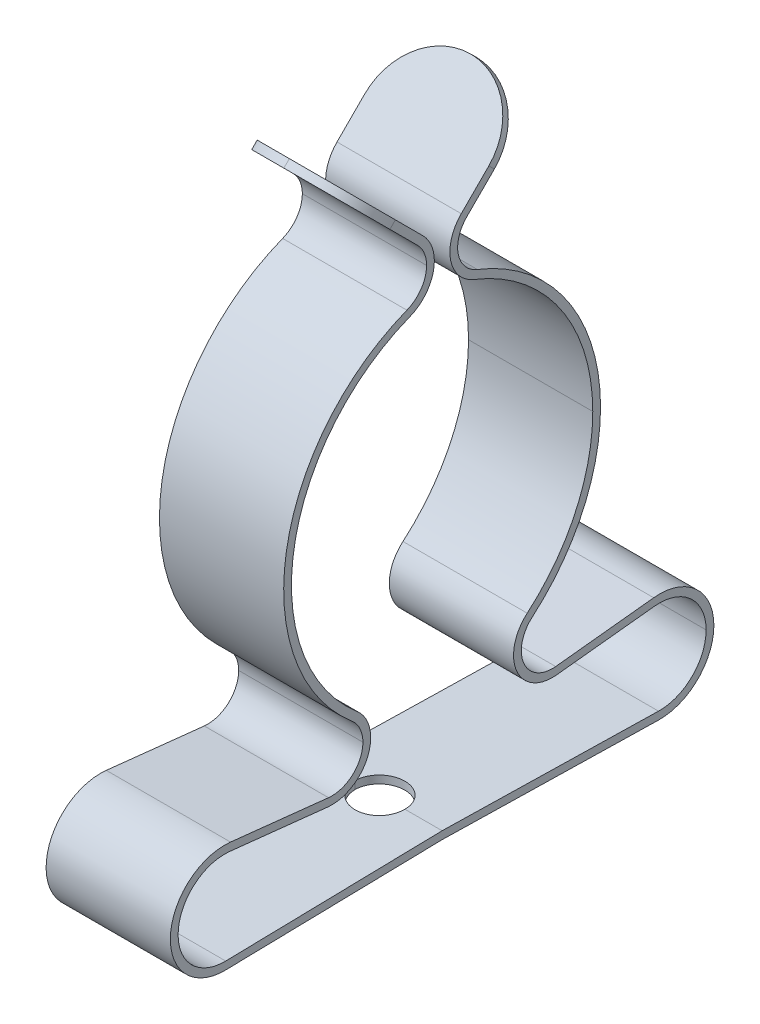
ISO-10303-21;
HEADER;
FILE_DESCRIPTION(('STEP AP214'),'2;1');
FILE_NAME('part.step','',(''),(''),'','','');
FILE_SCHEMA(('AUTOMOTIVE_DESIGN { 1 0 10303 214 1 1 1 1 }'));
ENDSEC;
DATA;
#1=APPLICATION_CONTEXT('core data for automotive mechanical design processes');
#2=APPLICATION_PROTOCOL_DEFINITION('international standard','automotive_design',2000,#1);
#3=PRODUCT_CONTEXT('',#1,'mechanical');
#4=PRODUCT('Part','Part','',(#3));
#5=PRODUCT_RELATED_PRODUCT_CATEGORY('part','',(#4));
#6=PRODUCT_DEFINITION_FORMATION('','',#4);
#7=PRODUCT_DEFINITION_CONTEXT('part definition',#1,'design');
#8=PRODUCT_DEFINITION('design','',#6,#7);
#9=PRODUCT_DEFINITION_SHAPE('','',#8);
#10=(LENGTH_UNIT() NAMED_UNIT(*) SI_UNIT(.MILLI.,.METRE.));
#11=(NAMED_UNIT(*) PLANE_ANGLE_UNIT() SI_UNIT($,.RADIAN.));
#12=(NAMED_UNIT(*) SI_UNIT($,.STERADIAN.) SOLID_ANGLE_UNIT());
#13=UNCERTAINTY_MEASURE_WITH_UNIT(LENGTH_MEASURE(1.E-05),#10,'distance_accuracy_value','');
#14=(GEOMETRIC_REPRESENTATION_CONTEXT(3) GLOBAL_UNCERTAINTY_ASSIGNED_CONTEXT((#13)) GLOBAL_UNIT_ASSIGNED_CONTEXT((#10,
#11,#12)) REPRESENTATION_CONTEXT('',''));
#15=CARTESIAN_POINT('',(0.,0.,0.));
#16=DIRECTION('',(0.,0.,1.));
#17=DIRECTION('',(1.,0.,0.));
#18=AXIS2_PLACEMENT_3D('',#15,#16,#17);
#19=CARTESIAN_POINT('',(17.3911017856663,49.5210946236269,22.0466817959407));
#20=DIRECTION('',(0.,-0.707106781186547,0.707106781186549));
#21=DIRECTION('',(0.,0.707106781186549,0.707106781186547));
#22=AXIS2_PLACEMENT_3D('',#19,#20,#21);
#23=CYLINDRICAL_SURFACE('',#22,4.);
#24=CARTESIAN_POINT('',(17.3911017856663,51.2888615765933,20.2789148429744));
#25=DIRECTION('',(0.,0.707106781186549,-0.707106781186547));
#26=DIRECTION('',(0.,-0.707106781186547,-0.707106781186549));
#27=AXIS2_PLACEMENT_3D('',#24,#25,#26);
#28=CIRCLE('',#27,4.);
#29=CARTESIAN_POINT('',(17.3911017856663,54.1172887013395,23.1073419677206));
#30=VERTEX_POINT('',#29);
#31=CARTESIAN_POINT('',(21.3911017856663,51.2888615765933,20.2789148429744));
#32=VERTEX_POINT('',#31);
#33=EDGE_CURVE('E655',#30,#32,#28,.T.);
#34=ORIENTED_EDGE('',*,*,#33,.F.);
#35=DIRECTION('',(0.,-0.707106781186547,0.707106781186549));
#36=VECTOR('',#35,1.);
#37=CARTESIAN_POINT('',(17.3911017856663,53.7637353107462,23.4608953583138));
#38=LINE('',#37,#36);
#39=CARTESIAN_POINT('',(17.3911017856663,53.7637353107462,23.4608953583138));
#40=VERTEX_POINT('',#39);
#41=EDGE_CURVE('E10',#30,#40,#38,.T.);
#42=ORIENTED_EDGE('',*,*,#41,.T.);
#43=CARTESIAN_POINT('',(17.3911017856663,50.935308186,20.6324682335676));
#44=DIRECTION('',(0.,-0.707106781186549,0.707106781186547));
#45=DIRECTION('',(0.,-0.707106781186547,-0.707106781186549));
#46=AXIS2_PLACEMENT_3D('',#43,#44,#45);
#47=CIRCLE('',#46,4.);
#48=CARTESIAN_POINT('',(21.3911017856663,50.935308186,20.6324682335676));
#49=VERTEX_POINT('',#48);
#50=EDGE_CURVE('E639',#49,#40,#47,.T.);
#51=ORIENTED_EDGE('',*,*,#50,.F.);
#52=DIRECTION('',(0.,-0.707106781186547,0.707106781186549));
#53=VECTOR('',#52,1.);
#54=CARTESIAN_POINT('',(21.3911017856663,49.5210946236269,22.0466817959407));
#55=LINE('',#54,#53);
#56=EDGE_CURVE('E409',#32,#49,#55,.T.);
#57=ORIENTED_EDGE('',*,*,#56,.F.);
#58=EDGE_LOOP('',(#34,#42,#51,#57));
#59=FACE_BOUND('',#58,.T.);
#60=ADVANCED_FACE('F15',(#59),#23,.T.);
#61=CARTESIAN_POINT('',(17.3911017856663,51.2888615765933,20.2789148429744));
#62=DIRECTION('',(0.,0.707106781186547,-0.707106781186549));
#63=DIRECTION('',(0.,-0.707106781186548,-0.707106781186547));
#64=AXIS2_PLACEMENT_3D('',#61,#62,#63);
#65=CYLINDRICAL_SURFACE('',#64,4.);
#66=ORIENTED_EDGE('',*,*,#41,.F.);
#67=CARTESIAN_POINT('',(17.3911017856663,51.2888615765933,20.2789148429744));
#68=DIRECTION('',(0.,0.707106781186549,-0.707106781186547));
#69=DIRECTION('',(0.,-0.707106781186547,-0.707106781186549));
#70=AXIS2_PLACEMENT_3D('',#67,#68,#69);
#71=CIRCLE('',#70,4.);
#72=CARTESIAN_POINT('',(13.3911017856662,51.2888615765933,20.2789148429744));
#73=VERTEX_POINT('',#72);
#74=EDGE_CURVE('E651',#73,#30,#71,.T.);
#75=ORIENTED_EDGE('',*,*,#74,.F.);
#76=DIRECTION('',(0.,0.707106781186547,-0.707106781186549));
#77=VECTOR('',#76,1.);
#78=CARTESIAN_POINT('',(13.3911017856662,51.2888615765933,20.2789148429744));
#79=LINE('',#78,#77);
#80=CARTESIAN_POINT('',(13.3911017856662,50.935308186,20.6324682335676));
#81=VERTEX_POINT('',#80);
#82=EDGE_CURVE('E407',#81,#73,#79,.T.);
#83=ORIENTED_EDGE('',*,*,#82,.F.);
#84=CARTESIAN_POINT('',(17.3911017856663,50.935308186,20.6324682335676));
#85=DIRECTION('',(0.,-0.707106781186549,0.707106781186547));
#86=DIRECTION('',(0.,-0.707106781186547,-0.707106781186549));
#87=AXIS2_PLACEMENT_3D('',#84,#85,#86);
#88=CIRCLE('',#87,4.);
#89=EDGE_CURVE('E643',#40,#81,#88,.T.);
#90=ORIENTED_EDGE('',*,*,#89,.F.);
#91=EDGE_LOOP('',(#66,#75,#83,#90));
#92=FACE_BOUND('',#91,.T.);
#93=ADVANCED_FACE('F995',(#92),#65,.T.);
#94=CARTESIAN_POINT('',(17.3911017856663,52.5210946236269,15.4932870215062));
#95=DIRECTION('',(0.,0.707106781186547,0.707106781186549));
#96=DIRECTION('',(0.,0.707106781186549,-0.707106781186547));
#97=AXIS2_PLACEMENT_3D('',#94,#95,#96);
#98=CYLINDRICAL_SURFACE('',#97,4.);
#99=CARTESIAN_POINT('',(17.3911017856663,50.935308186,13.9075005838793));
#100=DIRECTION('',(0.,-0.707106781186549,-0.707106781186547));
#101=DIRECTION('',(0.,0.707106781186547,-0.707106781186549));
#102=AXIS2_PLACEMENT_3D('',#99,#100,#101);
#103=CIRCLE('',#102,4.);
#104=CARTESIAN_POINT('',(17.3911017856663,53.7637353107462,11.0790734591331));
#105=VERTEX_POINT('',#104);
#106=CARTESIAN_POINT('',(21.3911017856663,50.935308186,13.9075005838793));
#107=VERTEX_POINT('',#106);
#108=EDGE_CURVE('E560',#105,#107,#103,.T.);
#109=ORIENTED_EDGE('',*,*,#108,.F.);
#110=DIRECTION('',(0.,0.707106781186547,0.707106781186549));
#111=VECTOR('',#110,1.);
#112=CARTESIAN_POINT('',(17.3911017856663,54.1172887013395,11.4326268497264));
#113=LINE('',#112,#111);
#114=CARTESIAN_POINT('',(17.3911017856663,54.1172887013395,11.4326268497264));
#115=VERTEX_POINT('',#114);
#116=EDGE_CURVE('E24',#105,#115,#113,.T.);
#117=ORIENTED_EDGE('',*,*,#116,.T.);
#118=CARTESIAN_POINT('',(17.3911017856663,51.2888615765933,14.2610539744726));
#119=DIRECTION('',(0.,0.707106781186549,0.707106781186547));
#120=DIRECTION('',(0.,0.707106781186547,-0.707106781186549));
#121=AXIS2_PLACEMENT_3D('',#118,#119,#120);
#122=CIRCLE('',#121,4.);
#123=CARTESIAN_POINT('',(21.3911017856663,51.2888615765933,14.2610539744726));
#124=VERTEX_POINT('',#123);
#125=EDGE_CURVE('E706',#124,#115,#122,.T.);
#126=ORIENTED_EDGE('',*,*,#125,.F.);
#127=DIRECTION('',(0.,0.707106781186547,0.707106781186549));
#128=VECTOR('',#127,1.);
#129=CARTESIAN_POINT('',(21.3911017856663,52.5210946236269,15.4932870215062));
#130=LINE('',#129,#128);
#131=EDGE_CURVE('E416',#107,#124,#130,.T.);
#132=ORIENTED_EDGE('',*,*,#131,.F.);
#133=EDGE_LOOP('',(#109,#117,#126,#132));
#134=FACE_BOUND('',#133,.T.);
#135=ADVANCED_FACE('F934',(#134),#98,.T.);
#136=CARTESIAN_POINT('',(17.3911017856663,50.935308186,13.9075005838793));
#137=DIRECTION('',(0.,-0.707106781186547,-0.707106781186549));
#138=DIRECTION('',(0.,-0.707106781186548,0.707106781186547));
#139=AXIS2_PLACEMENT_3D('',#136,#137,#138);
#140=CYLINDRICAL_SURFACE('',#139,4.);
#141=ORIENTED_EDGE('',*,*,#116,.F.);
#142=CARTESIAN_POINT('',(17.3911017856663,50.935308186,13.9075005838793));
#143=DIRECTION('',(0.,-0.707106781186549,-0.707106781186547));
#144=DIRECTION('',(0.,0.707106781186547,-0.707106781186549));
#145=AXIS2_PLACEMENT_3D('',#142,#143,#144);
#146=CIRCLE('',#145,4.);
#147=CARTESIAN_POINT('',(13.3911017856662,50.935308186,13.9075005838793));
#148=VERTEX_POINT('',#147);
#149=EDGE_CURVE('E565',#148,#105,#146,.T.);
#150=ORIENTED_EDGE('',*,*,#149,.F.);
#151=DIRECTION('',(0.,-0.707106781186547,-0.707106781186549));
#152=VECTOR('',#151,1.);
#153=CARTESIAN_POINT('',(13.3911017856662,50.935308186,13.9075005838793));
#154=LINE('',#153,#152);
#155=CARTESIAN_POINT('',(13.3911017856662,51.2888615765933,14.2610539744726));
#156=VERTEX_POINT('',#155);
#157=EDGE_CURVE('E405',#156,#148,#154,.T.);
#158=ORIENTED_EDGE('',*,*,#157,.F.);
#159=CARTESIAN_POINT('',(17.3911017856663,51.2888615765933,14.2610539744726));
#160=DIRECTION('',(0.,0.707106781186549,0.707106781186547));
#161=DIRECTION('',(0.,0.707106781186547,-0.707106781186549));
#162=AXIS2_PLACEMENT_3D('',#159,#160,#161);
#163=CIRCLE('',#162,4.);
#164=EDGE_CURVE('E702',#115,#156,#163,.T.);
#165=ORIENTED_EDGE('',*,*,#164,.F.);
#166=EDGE_LOOP('',(#141,#150,#158,#165));
#167=FACE_BOUND('',#166,.T.);
#168=ADVANCED_FACE('F941',(#167),#140,.T.);
#169=CARTESIAN_POINT('',(17.3911017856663,16.4172887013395,17.2699844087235));
#170=DIRECTION('',(0.,-1.,0.));
#171=DIRECTION('',(1.,0.,0.));
#172=AXIS2_PLACEMENT_3D('',#169,#170,#171);
#173=CYLINDRICAL_SURFACE('',#172,1.6);
#174=DIRECTION('',(0.,-1.,0.));
#175=VECTOR('',#174,1.);
#176=CARTESIAN_POINT('',(15.7911017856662,16.4172887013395,17.2699844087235));
#177=LINE('',#176,#175);
#178=CARTESIAN_POINT('',(15.7911017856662,15.7172887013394,17.2699844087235));
#179=VERTEX_POINT('',#178);
#180=CARTESIAN_POINT('',(15.7911017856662,15.2171733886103,17.2699844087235));
#181=VERTEX_POINT('',#180);
#182=EDGE_CURVE('E849',#179,#181,#177,.T.);
#183=ORIENTED_EDGE('',*,*,#182,.F.);
#184=CARTESIAN_POINT('',(15.7911017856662,15.7172887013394,17.2699844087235));
#185=CARTESIAN_POINT('',(15.7911017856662,15.6485591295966,20.4699844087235));
#186=CARTESIAN_POINT('',(18.9911017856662,15.6485591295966,20.4699844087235));
#187=CARTESIAN_POINT('',(18.9911017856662,15.7172887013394,17.2699844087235));
#188=(BOUNDED_CURVE() B_SPLINE_CURVE(3,(#184,#185,#186,#187),.UNSPECIFIED.,.F.,
.F.) B_SPLINE_CURVE_WITH_KNOTS((4,4),(4.71238898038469,7.85398163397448),
.UNSPECIFIED.) CURVE() GEOMETRIC_REPRESENTATION_ITEM() RATIONAL_B_SPLINE_CURVE((1.,
0.333333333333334,0.333333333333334,1.)) REPRESENTATION_ITEM(''));
#189=CARTESIAN_POINT('',(18.9911017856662,15.7172887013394,17.2699844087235));
#190=VERTEX_POINT('',#189);
#191=EDGE_CURVE('E592',#179,#190,#188,.T.);
#192=ORIENTED_EDGE('',*,*,#191,.T.);
#193=DIRECTION('',(0.,-1.,0.));
#194=VECTOR('',#193,1.);
#195=CARTESIAN_POINT('',(18.9911017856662,16.4172887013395,17.2699844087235));
#196=LINE('',#195,#194);
#197=CARTESIAN_POINT('',(18.9911017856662,15.2171733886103,17.2699844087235));
#198=VERTEX_POINT('',#197);
#199=EDGE_CURVE('E440',#190,#198,#196,.T.);
#200=ORIENTED_EDGE('',*,*,#199,.T.);
#201=CARTESIAN_POINT('',(15.7911017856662,15.2171733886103,17.2699844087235));
#202=CARTESIAN_POINT('',(15.7911017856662,15.1484438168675,20.4699844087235));
#203=CARTESIAN_POINT('',(18.9911017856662,15.1484438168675,20.4699844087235));
#204=CARTESIAN_POINT('',(18.9911017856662,15.2171733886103,17.2699844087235));
#205=(BOUNDED_CURVE() B_SPLINE_CURVE(3,(#201,#202,#203,#204),.UNSPECIFIED.,.F.,
.F.) B_SPLINE_CURVE_WITH_KNOTS((4,4),(4.71238898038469,7.85398163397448),
.UNSPECIFIED.) CURVE() GEOMETRIC_REPRESENTATION_ITEM() RATIONAL_B_SPLINE_CURVE((1.,
0.333333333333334,0.333333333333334,1.)) REPRESENTATION_ITEM(''));
#206=EDGE_CURVE('E574',#181,#198,#205,.T.);
#207=ORIENTED_EDGE('',*,*,#206,.F.);
#208=EDGE_LOOP('',(#183,#192,#200,#207));
#209=FACE_BOUND('',#208,.T.);
#210=ADVANCED_FACE('F906',(#209),#173,.F.);
#211=CARTESIAN_POINT('',(21.3911017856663,47.7443972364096,20.2699844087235));
#212=DIRECTION('',(1.,0.,0.));
#213=DIRECTION('',(0.,-1.,0.));
#214=AXIS2_PLACEMENT_3D('',#211,#212,#213);
#215=PLANE('',#214);
#216=DIRECTION('',(0.,-0.707106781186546,0.707106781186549));
#217=VECTOR('',#216,1.);
#218=CARTESIAN_POINT('',(21.3911017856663,49.1586107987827,15.6841979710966));
#219=LINE('',#218,#217);
#220=CARTESIAN_POINT('',(21.3911017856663,49.1586107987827,15.6841979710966));
#221=VERTEX_POINT('',#220);
#222=EDGE_CURVE('E564',#107,#221,#219,.T.);
#223=ORIENTED_EDGE('',*,*,#222,.F.);
#224=ORIENTED_EDGE('',*,*,#131,.T.);
#225=DIRECTION('',(0.,-0.707106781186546,0.707106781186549));
#226=VECTOR('',#225,1.);
#227=CARTESIAN_POINT('',(21.3911017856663,49.512164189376,16.0377513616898));
#228=LINE('',#227,#226);
#229=CARTESIAN_POINT('',(21.3911017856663,49.512164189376,16.0377513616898));
#230=VERTEX_POINT('',#229);
#231=EDGE_CURVE('E775',#124,#230,#228,.T.);
#232=ORIENTED_EDGE('',*,*,#231,.T.);
#233=CARTESIAN_POINT('',(21.3911017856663,47.7443972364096,14.2699844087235));
#234=DIRECTION('',(1.,0.,0.));
#235=DIRECTION('',(0.,0.,1.));
#236=AXIS2_PLACEMENT_3D('',#233,#234,#235);
#237=CIRCLE('',#236,2.5);
#238=CARTESIAN_POINT('',(21.3911017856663,45.4172887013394,15.1835301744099));
#239=VERTEX_POINT('',#238);
#240=EDGE_CURVE('E493',#230,#239,#237,.T.);
#241=ORIENTED_EDGE('',*,*,#240,.T.);
#242=CARTESIAN_POINT('',(21.3911017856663,34.2471677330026,19.5685498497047));
#243=DIRECTION('',(-1.,0.,0.));
#244=DIRECTION('',(0.,0.,-1.));
#245=AXIS2_PLACEMENT_3D('',#242,#243,#244);
#246=CIRCLE('',#245,12.);
#247=CARTESIAN_POINT('',(21.3911017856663,34.2471677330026,7.56854984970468));
#248=VERTEX_POINT('',#247);
#249=EDGE_CURVE('E550',#239,#248,#246,.T.);
#250=ORIENTED_EDGE('',*,*,#249,.T.);
#251=CARTESIAN_POINT('',(21.3911017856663,34.2471677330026,19.5685498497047));
#252=DIRECTION('',(-1.,0.,0.));
#253=DIRECTION('',(0.,0.,-1.));
#254=AXIS2_PLACEMENT_3D('',#251,#252,#253);
#255=CIRCLE('',#254,12.);
#256=CARTESIAN_POINT('',(21.3911017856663,25.1092904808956,11.790426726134));
#257=VERTEX_POINT('',#256);
#258=EDGE_CURVE('E497',#248,#257,#255,.T.);
#259=ORIENTED_EDGE('',*,*,#258,.T.);
#260=CARTESIAN_POINT('',(21.3911017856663,23.2055660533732,10.1699844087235));
#261=DIRECTION('',(1.,0.,0.));
#262=DIRECTION('',(0.,0.,1.));
#263=AXIS2_PLACEMENT_3D('',#260,#261,#262);
#264=CIRCLE('',#263,2.5);
#265=CARTESIAN_POINT('',(21.3911017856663,20.7199569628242,9.90212726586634));
#266=VERTEX_POINT('',#265);
#267=EDGE_CURVE('E513',#257,#266,#264,.T.);
#268=ORIENTED_EDGE('',*,*,#267,.T.);
#269=DIRECTION('',(0.,0.107142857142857,-0.994243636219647));
#270=VECTOR('',#269,1.);
#271=CARTESIAN_POINT('',(21.3911017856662,21.4000196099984,3.59141298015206));
#272=LINE('',#271,#270);
#273=CARTESIAN_POINT('',(21.3911017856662,21.4000196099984,3.59141298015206));
#274=VERTEX_POINT('',#273);
#275=EDGE_CURVE('E754',#266,#274,#272,.T.);
#276=ORIENTED_EDGE('',*,*,#275,.T.);
#277=CARTESIAN_POINT('',(21.3911017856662,18.4172887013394,3.26998440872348));
#278=DIRECTION('',(-1.,0.,0.));
#279=DIRECTION('',(0.,0.,-1.));
#280=AXIS2_PLACEMENT_3D('',#277,#278,#279);
#281=CIRCLE('',#280,3.);
#282=CARTESIAN_POINT('',(21.3911017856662,18.4172887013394,0.269984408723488));
#283=VERTEX_POINT('',#282);
#284=EDGE_CURVE('E578',#274,#283,#281,.T.);
#285=ORIENTED_EDGE('',*,*,#284,.T.);
#286=CARTESIAN_POINT('',(21.3911017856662,18.4172887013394,3.26998440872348));
#287=DIRECTION('',(-1.,0.,0.));
#288=DIRECTION('',(0.,0.,-1.));
#289=AXIS2_PLACEMENT_3D('',#286,#287,#288);
#290=CIRCLE('',#289,3.);
#291=CARTESIAN_POINT('',(21.3911017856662,15.4179804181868,3.33440352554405));
#292=VERTEX_POINT('',#291);
#293=EDGE_CURVE('E457',#283,#292,#290,.T.);
#294=ORIENTED_EDGE('',*,*,#293,.T.);
#295=DIRECTION('',(0.,0.0214730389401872,0.999769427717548));
#296=VECTOR('',#295,1.);
#297=CARTESIAN_POINT('',(21.3911017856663,15.7172887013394,17.2699844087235));
#298=LINE('',#297,#296);
#299=CARTESIAN_POINT('',(21.3911017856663,15.7172887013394,17.2699844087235));
#300=VERTEX_POINT('',#299);
#301=EDGE_CURVE('E743',#292,#300,#298,.T.);
#302=ORIENTED_EDGE('',*,*,#301,.T.);
#303=DIRECTION('',(0.,-0.0214730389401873,0.999769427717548));
#304=VECTOR('',#303,1.);
#305=CARTESIAN_POINT('',(21.3911017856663,15.7172887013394,17.2699844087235));
#306=LINE('',#305,#304);
#307=CARTESIAN_POINT('',(21.3911017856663,15.4179804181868,31.2055652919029));
#308=VERTEX_POINT('',#307);
#309=EDGE_CURVE('E604',#300,#308,#306,.T.);
#310=ORIENTED_EDGE('',*,*,#309,.T.);
#311=CARTESIAN_POINT('',(21.3911017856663,18.4172887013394,31.2699844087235));
#312=DIRECTION('',(-1.,0.,0.));
#313=DIRECTION('',(0.,0.,1.));
#314=AXIS2_PLACEMENT_3D('',#311,#312,#313);
#315=CIRCLE('',#314,3.);
#316=CARTESIAN_POINT('',(21.3911017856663,21.4000196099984,30.9485558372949));
#317=VERTEX_POINT('',#316);
#318=EDGE_CURVE('E719',#308,#317,#315,.T.);
#319=ORIENTED_EDGE('',*,*,#318,.T.);
#320=DIRECTION('',(0.,-0.107142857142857,-0.994243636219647));
#321=VECTOR('',#320,1.);
#322=CARTESIAN_POINT('',(21.3911017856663,21.4000196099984,30.9485558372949));
#323=LINE('',#322,#321);
#324=CARTESIAN_POINT('',(21.3911017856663,20.7199569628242,24.6378415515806));
#325=VERTEX_POINT('',#324);
#326=EDGE_CURVE('E701',#317,#325,#323,.T.);
#327=ORIENTED_EDGE('',*,*,#326,.T.);
#328=CARTESIAN_POINT('',(21.3911017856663,23.2055660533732,24.3699844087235));
#329=DIRECTION('',(1.,0.,0.));
#330=DIRECTION('',(0.,0.,-1.));
#331=AXIS2_PLACEMENT_3D('',#328,#329,#330);
#332=CIRCLE('',#331,2.5);
#333=CARTESIAN_POINT('',(21.3911017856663,23.2055660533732,21.8699844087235));
#334=VERTEX_POINT('',#333);
#335=EDGE_CURVE('E597',#325,#334,#332,.T.);
#336=ORIENTED_EDGE('',*,*,#335,.T.);
#337=CARTESIAN_POINT('',(21.3911017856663,23.2055660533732,24.3699844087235));
#338=DIRECTION('',(1.,0.,0.));
#339=DIRECTION('',(0.,0.,-1.));
#340=AXIS2_PLACEMENT_3D('',#337,#338,#339);
#341=CIRCLE('',#340,2.5);
#342=CARTESIAN_POINT('',(21.3911017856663,25.1092904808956,22.749542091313));
#343=VERTEX_POINT('',#342);
#344=EDGE_CURVE('E438',#334,#343,#341,.T.);
#345=ORIENTED_EDGE('',*,*,#344,.T.);
#346=CARTESIAN_POINT('',(21.3911017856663,34.2471677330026,14.9714189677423));
#347=DIRECTION('',(-1.,0.,0.));
#348=DIRECTION('',(0.,0.,1.));
#349=AXIS2_PLACEMENT_3D('',#346,#347,#348);
#350=CIRCLE('',#349,12.);
#351=CARTESIAN_POINT('',(21.3911017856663,45.4172887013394,19.3564386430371));
#352=VERTEX_POINT('',#351);
#353=EDGE_CURVE('E529',#343,#352,#350,.T.);
#354=ORIENTED_EDGE('',*,*,#353,.T.);
#355=CARTESIAN_POINT('',(21.3911017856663,47.7443972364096,20.2699844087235));
#356=DIRECTION('',(1.,0.,0.));
#357=DIRECTION('',(0.,0.,-1.));
#358=AXIS2_PLACEMENT_3D('',#355,#356,#357);
#359=CIRCLE('',#358,2.5);
#360=CARTESIAN_POINT('',(21.3911017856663,47.7443972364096,17.7699844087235));
#361=VERTEX_POINT('',#360);
#362=EDGE_CURVE('E620',#352,#361,#359,.T.);
#363=ORIENTED_EDGE('',*,*,#362,.T.);
#364=CARTESIAN_POINT('',(21.3911017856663,47.7443972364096,20.2699844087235));
#365=DIRECTION('',(1.,0.,0.));
#366=DIRECTION('',(0.,0.,-1.));
#367=AXIS2_PLACEMENT_3D('',#364,#365,#366);
#368=CIRCLE('',#367,2.5);
#369=CARTESIAN_POINT('',(21.3911017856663,49.512164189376,18.5022174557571));
#370=VERTEX_POINT('',#369);
#371=EDGE_CURVE('E533',#361,#370,#368,.T.);
#372=ORIENTED_EDGE('',*,*,#371,.T.);
#373=DIRECTION('',(0.,0.707106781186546,0.707106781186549));
#374=VECTOR('',#373,1.);
#375=CARTESIAN_POINT('',(21.3911017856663,49.512164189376,18.5022174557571));
#376=LINE('',#375,#374);
#377=EDGE_CURVE('E659',#370,#32,#376,.T.);
#378=ORIENTED_EDGE('',*,*,#377,.T.);
#379=ORIENTED_EDGE('',*,*,#56,.T.);
#380=DIRECTION('',(0.,0.707106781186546,0.707106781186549));
#381=VECTOR('',#380,1.);
#382=CARTESIAN_POINT('',(21.3911017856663,49.1586107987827,18.8557708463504));
#383=LINE('',#382,#381);
#384=CARTESIAN_POINT('',(21.3911017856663,49.1586107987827,18.8557708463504));
#385=VERTEX_POINT('',#384);
#386=EDGE_CURVE('E632',#385,#49,#383,.T.);
#387=ORIENTED_EDGE('',*,*,#386,.F.);
#388=CARTESIAN_POINT('',(21.3911017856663,47.7443972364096,20.2699844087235));
#389=DIRECTION('',(1.,0.,0.));
#390=DIRECTION('',(0.,0.,1.));
#391=AXIS2_PLACEMENT_3D('',#388,#389,#390);
#392=CIRCLE('',#391,2.);
#393=CARTESIAN_POINT('',(21.3911017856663,47.7443972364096,18.2699844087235));
#394=VERTEX_POINT('',#393);
#395=EDGE_CURVE('E453',#394,#385,#392,.T.);
#396=ORIENTED_EDGE('',*,*,#395,.F.);
#397=CARTESIAN_POINT('',(21.3911017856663,47.7443972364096,20.2699844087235));
#398=DIRECTION('',(1.,0.,0.));
#399=DIRECTION('',(0.,0.,1.));
#400=AXIS2_PLACEMENT_3D('',#397,#398,#399);
#401=CIRCLE('',#400,2.);
#402=CARTESIAN_POINT('',(21.3911017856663,45.8827104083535,19.5391477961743));
#403=VERTEX_POINT('',#402);
#404=EDGE_CURVE('E404',#403,#394,#401,.T.);
#405=ORIENTED_EDGE('',*,*,#404,.F.);
#406=CARTESIAN_POINT('',(21.3911017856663,34.2471677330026,14.9714189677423));
#407=DIRECTION('',(-1.,0.,0.));
#408=DIRECTION('',(0.,0.,1.));
#409=AXIS2_PLACEMENT_3D('',#406,#407,#408);
#410=CIRCLE('',#409,12.5);
#411=CARTESIAN_POINT('',(21.3911017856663,24.7285455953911,23.0736305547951));
#412=VERTEX_POINT('',#411);
#413=EDGE_CURVE('E394',#412,#403,#410,.T.);
#414=ORIENTED_EDGE('',*,*,#413,.F.);
#415=CARTESIAN_POINT('',(21.3911017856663,23.2055660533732,24.3699844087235));
#416=DIRECTION('',(1.,0.,0.));
#417=DIRECTION('',(0.,0.,1.));
#418=AXIS2_PLACEMENT_3D('',#415,#416,#417);
#419=CIRCLE('',#418,2.);
#420=CARTESIAN_POINT('',(21.3911017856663,23.2055660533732,22.3699844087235));
#421=VERTEX_POINT('',#420);
#422=EDGE_CURVE('E428',#421,#412,#419,.T.);
#423=ORIENTED_EDGE('',*,*,#422,.F.);
#424=CARTESIAN_POINT('',(21.3911017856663,23.2055660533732,24.3699844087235));
#425=DIRECTION('',(1.,0.,0.));
#426=DIRECTION('',(0.,0.,1.));
#427=AXIS2_PLACEMENT_3D('',#424,#425,#426);
#428=CIRCLE('',#427,2.);
#429=CARTESIAN_POINT('',(21.3911017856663,21.2170787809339,24.5842701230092));
#430=VERTEX_POINT('',#429);
#431=EDGE_CURVE('E391',#430,#421,#428,.T.);
#432=ORIENTED_EDGE('',*,*,#431,.F.);
#433=DIRECTION('',(0.,-0.107142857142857,-0.994243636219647));
#434=VECTOR('',#433,1.);
#435=CARTESIAN_POINT('',(21.3911017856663,21.8971414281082,30.8949844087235));
#436=LINE('',#435,#434);
#437=CARTESIAN_POINT('',(21.3911017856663,21.8971414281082,30.8949844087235));
#438=VERTEX_POINT('',#437);
#439=EDGE_CURVE('E374',#438,#430,#436,.T.);
#440=ORIENTED_EDGE('',*,*,#439,.F.);
#441=CARTESIAN_POINT('',(21.3911017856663,18.4172887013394,31.2699844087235));
#442=DIRECTION('',(-1.,0.,0.));
#443=DIRECTION('',(0.,0.,1.));
#444=AXIS2_PLACEMENT_3D('',#441,#442,#443);
#445=CIRCLE('',#444,3.5);
#446=CARTESIAN_POINT('',(21.3911017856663,14.918095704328,31.1948287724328));
#447=VERTEX_POINT('',#446);
#448=EDGE_CURVE('E377',#447,#438,#445,.T.);
#449=ORIENTED_EDGE('',*,*,#448,.F.);
#450=DIRECTION('',(0.,-0.0214730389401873,0.999769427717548));
#451=VECTOR('',#450,1.);
#452=CARTESIAN_POINT('',(21.3911017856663,15.2174039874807,17.2592478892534));
#453=LINE('',#452,#451);
#454=CARTESIAN_POINT('',(21.3911017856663,15.2171733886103,17.2699844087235));
#455=VERTEX_POINT('',#454);
#456=EDGE_CURVE('E521',#455,#447,#453,.T.);
#457=ORIENTED_EDGE('',*,*,#456,.F.);
#458=DIRECTION('',(0.,0.0214730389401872,0.999769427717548));
#459=VECTOR('',#458,1.);
#460=CARTESIAN_POINT('',(21.3911017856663,15.2174039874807,17.2807209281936));
#461=LINE('',#460,#459);
#462=CARTESIAN_POINT('',(21.3911017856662,14.918095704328,3.34514004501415));
#463=VERTEX_POINT('',#462);
#464=EDGE_CURVE('E570',#463,#455,#461,.T.);
#465=ORIENTED_EDGE('',*,*,#464,.F.);
#466=CARTESIAN_POINT('',(21.3911017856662,18.4172887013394,3.26998440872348));
#467=DIRECTION('',(-1.,0.,0.));
#468=DIRECTION('',(0.,0.,1.));
#469=AXIS2_PLACEMENT_3D('',#466,#467,#468);
#470=CIRCLE('',#469,3.5);
#471=CARTESIAN_POINT('',(21.3911017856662,18.4172887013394,-0.230015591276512));
#472=VERTEX_POINT('',#471);
#473=EDGE_CURVE('E467',#472,#463,#470,.T.);
#474=ORIENTED_EDGE('',*,*,#473,.F.);
#475=CARTESIAN_POINT('',(21.3911017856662,18.4172887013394,3.26998440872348));
#476=DIRECTION('',(-1.,0.,0.));
#477=DIRECTION('',(0.,0.,1.));
#478=AXIS2_PLACEMENT_3D('',#475,#476,#477);
#479=CIRCLE('',#478,3.5);
#480=CARTESIAN_POINT('',(21.3911017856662,21.8971414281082,3.64498440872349));
#481=VERTEX_POINT('',#480);
#482=EDGE_CURVE('E760',#481,#472,#479,.T.);
#483=ORIENTED_EDGE('',*,*,#482,.F.);
#484=DIRECTION('',(0.,0.107142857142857,-0.994243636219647));
#485=VECTOR('',#484,1.);
#486=CARTESIAN_POINT('',(21.3911017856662,21.8971414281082,3.64498440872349));
#487=LINE('',#486,#485);
#488=CARTESIAN_POINT('',(21.3911017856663,21.2170787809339,9.95569869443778));
#489=VERTEX_POINT('',#488);
#490=EDGE_CURVE('E489',#489,#481,#487,.T.);
#491=ORIENTED_EDGE('',*,*,#490,.F.);
#492=CARTESIAN_POINT('',(21.3911017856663,23.2055660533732,10.1699844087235));
#493=DIRECTION('',(1.,0.,0.));
#494=DIRECTION('',(0.,0.,1.));
#495=AXIS2_PLACEMENT_3D('',#492,#493,#494);
#496=CIRCLE('',#495,2.);
#497=CARTESIAN_POINT('',(21.3911017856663,24.7285455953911,11.4663382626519));
#498=VERTEX_POINT('',#497);
#499=EDGE_CURVE('E434',#498,#489,#496,.T.);
#500=ORIENTED_EDGE('',*,*,#499,.F.);
#501=CARTESIAN_POINT('',(21.3911017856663,34.2471677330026,19.5685498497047));
#502=DIRECTION('',(-1.,0.,0.));
#503=DIRECTION('',(0.,0.,1.));
#504=AXIS2_PLACEMENT_3D('',#501,#502,#503);
#505=CIRCLE('',#504,12.5);
#506=CARTESIAN_POINT('',(21.3911017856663,34.2471677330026,7.06854984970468));
#507=VERTEX_POINT('',#506);
#508=EDGE_CURVE('E525',#507,#498,#505,.T.);
#509=ORIENTED_EDGE('',*,*,#508,.F.);
#510=CARTESIAN_POINT('',(21.3911017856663,34.2471677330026,19.5685498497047));
#511=DIRECTION('',(-1.,0.,0.));
#512=DIRECTION('',(0.,0.,1.));
#513=AXIS2_PLACEMENT_3D('',#510,#511,#512);
#514=CIRCLE('',#513,12.5);
#515=CARTESIAN_POINT('',(21.3911017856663,45.8827104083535,15.0008210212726));
#516=VERTEX_POINT('',#515);
#517=EDGE_CURVE('E598',#516,#507,#514,.T.);
#518=ORIENTED_EDGE('',*,*,#517,.F.);
#519=CARTESIAN_POINT('',(21.3911017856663,47.7443972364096,14.2699844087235));
#520=DIRECTION('',(1.,0.,0.));
#521=DIRECTION('',(0.,0.,1.));
#522=AXIS2_PLACEMENT_3D('',#519,#520,#521);
#523=CIRCLE('',#522,2.);
#524=EDGE_CURVE('E788',#221,#516,#523,.T.);
#525=ORIENTED_EDGE('',*,*,#524,.F.);
#526=EDGE_LOOP('',(#223,#224,#232,#241,#250,#259,#268,#276,#285,#294,#302,#310,#319,#327,#336,
#345,#354,#363,#372,#378,#379,#387,#396,#405,#414,#423,#432,#440,#449,#457,#465,#474,#483,#491,
#500,#509,#518,#525));
#527=FACE_BOUND('',#526,.T.);
#528=ADVANCED_FACE('F811',(#527),#215,.T.);
#529=CARTESIAN_POINT('',(13.3911017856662,47.7443972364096,20.2699844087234));
#530=DIRECTION('',(1.,0.,0.));
#531=DIRECTION('',(0.,-1.,0.));
#532=AXIS2_PLACEMENT_3D('',#529,#530,#531);
#533=PLANE('',#532);
#534=DIRECTION('',(0.,-0.707106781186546,0.707106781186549));
#535=VECTOR('',#534,1.);
#536=CARTESIAN_POINT('',(13.3911017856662,49.512164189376,16.0377513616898));
#537=LINE('',#536,#535);
#538=CARTESIAN_POINT('',(13.3911017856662,49.512164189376,16.0377513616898));
#539=VERTEX_POINT('',#538);
#540=EDGE_CURVE('E696',#156,#539,#537,.T.);
#541=ORIENTED_EDGE('',*,*,#540,.F.);
#542=ORIENTED_EDGE('',*,*,#157,.T.);
#543=DIRECTION('',(0.,-0.707106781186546,0.707106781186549));
#544=VECTOR('',#543,1.);
#545=CARTESIAN_POINT('',(13.3911017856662,49.1586107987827,15.6841979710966));
#546=LINE('',#545,#544);
#547=CARTESIAN_POINT('',(13.3911017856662,49.1586107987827,15.6841979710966));
#548=VERTEX_POINT('',#547);
#549=EDGE_CURVE('E784',#148,#548,#546,.T.);
#550=ORIENTED_EDGE('',*,*,#549,.T.);
#551=CARTESIAN_POINT('',(13.3911017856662,47.7443972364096,14.2699844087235));
#552=DIRECTION('',(1.,0.,0.));
#553=DIRECTION('',(0.,0.,1.));
#554=AXIS2_PLACEMENT_3D('',#551,#552,#553);
#555=CIRCLE('',#554,2.);
#556=CARTESIAN_POINT('',(13.3911017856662,45.8827104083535,15.0008210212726));
#557=VERTEX_POINT('',#556);
#558=EDGE_CURVE('E793',#548,#557,#555,.T.);
#559=ORIENTED_EDGE('',*,*,#558,.T.);
#560=CARTESIAN_POINT('',(13.3911017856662,34.2471677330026,19.5685498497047));
#561=DIRECTION('',(-1.,0.,0.));
#562=DIRECTION('',(0.,0.,1.));
#563=AXIS2_PLACEMENT_3D('',#560,#561,#562);
#564=CIRCLE('',#563,12.5);
#565=CARTESIAN_POINT('',(13.3911017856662,34.2471677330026,7.06854984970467));
#566=VERTEX_POINT('',#565);
#567=EDGE_CURVE('E601',#557,#566,#564,.T.);
#568=ORIENTED_EDGE('',*,*,#567,.T.);
#569=CARTESIAN_POINT('',(13.3911017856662,34.2471677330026,19.5685498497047));
#570=DIRECTION('',(-1.,0.,0.));
#571=DIRECTION('',(0.,0.,1.));
#572=AXIS2_PLACEMENT_3D('',#569,#570,#571);
#573=CIRCLE('',#572,12.5);
#574=CARTESIAN_POINT('',(13.3911017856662,24.7285455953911,11.4663382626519));
#575=VERTEX_POINT('',#574);
#576=EDGE_CURVE('E501',#566,#575,#573,.T.);
#577=ORIENTED_EDGE('',*,*,#576,.T.);
#578=CARTESIAN_POINT('',(13.3911017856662,23.2055660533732,10.1699844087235));
#579=DIRECTION('',(1.,0.,0.));
#580=DIRECTION('',(0.,0.,1.));
#581=AXIS2_PLACEMENT_3D('',#578,#579,#580);
#582=CIRCLE('',#581,2.);
#583=CARTESIAN_POINT('',(13.3911017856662,21.2170787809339,9.95569869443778));
#584=VERTEX_POINT('',#583);
#585=EDGE_CURVE('E433',#575,#584,#582,.T.);
#586=ORIENTED_EDGE('',*,*,#585,.T.);
#587=DIRECTION('',(0.,0.107142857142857,-0.994243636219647));
#588=VECTOR('',#587,1.);
#589=CARTESIAN_POINT('',(13.3911017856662,21.8971414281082,3.64498440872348));
#590=LINE('',#589,#588);
#591=CARTESIAN_POINT('',(13.3911017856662,21.8971414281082,3.64498440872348));
#592=VERTEX_POINT('',#591);
#593=EDGE_CURVE('E488',#584,#592,#590,.T.);
#594=ORIENTED_EDGE('',*,*,#593,.T.);
#595=CARTESIAN_POINT('',(13.3911017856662,18.4172887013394,3.26998440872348));
#596=DIRECTION('',(-1.,0.,0.));
#597=DIRECTION('',(0.,0.,1.));
#598=AXIS2_PLACEMENT_3D('',#595,#596,#597);
#599=CIRCLE('',#598,3.5);
#600=CARTESIAN_POINT('',(13.3911017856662,18.4172887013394,-0.230015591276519));
#601=VERTEX_POINT('',#600);
#602=EDGE_CURVE('E624',#592,#601,#599,.T.);
#603=ORIENTED_EDGE('',*,*,#602,.T.);
#604=CARTESIAN_POINT('',(13.3911017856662,18.4172887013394,3.26998440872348));
#605=DIRECTION('',(-1.,0.,0.));
#606=DIRECTION('',(0.,0.,1.));
#607=AXIS2_PLACEMENT_3D('',#604,#605,#606);
#608=CIRCLE('',#607,3.5);
#609=CARTESIAN_POINT('',(13.3911017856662,14.918095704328,3.34514004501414));
#610=VERTEX_POINT('',#609);
#611=EDGE_CURVE('E483',#601,#610,#608,.T.);
#612=ORIENTED_EDGE('',*,*,#611,.T.);
#613=DIRECTION('',(0.,0.0214730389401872,0.999769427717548));
#614=VECTOR('',#613,1.);
#615=CARTESIAN_POINT('',(13.3911017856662,15.2174039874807,17.2807209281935));
#616=LINE('',#615,#614);
#617=CARTESIAN_POINT('',(13.3911017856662,15.2171733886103,17.2699844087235));
#618=VERTEX_POINT('',#617);
#619=EDGE_CURVE('E506',#610,#618,#616,.T.);
#620=ORIENTED_EDGE('',*,*,#619,.T.);
#621=DIRECTION('',(0.,-0.0214730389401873,0.999769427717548));
#622=VECTOR('',#621,1.);
#623=CARTESIAN_POINT('',(13.3911017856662,15.2174039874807,17.2592478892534));
#624=LINE('',#623,#622);
#625=CARTESIAN_POINT('',(13.3911017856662,14.918095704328,31.1948287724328));
#626=VERTEX_POINT('',#625);
#627=EDGE_CURVE('E369',#618,#626,#624,.T.);
#628=ORIENTED_EDGE('',*,*,#627,.T.);
#629=CARTESIAN_POINT('',(13.3911017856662,18.4172887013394,31.2699844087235));
#630=DIRECTION('',(-1.,0.,0.));
#631=DIRECTION('',(0.,0.,1.));
#632=AXIS2_PLACEMENT_3D('',#629,#630,#631);
#633=CIRCLE('',#632,3.5);
#634=CARTESIAN_POINT('',(13.3911017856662,21.8971414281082,30.8949844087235));
#635=VERTEX_POINT('',#634);
#636=EDGE_CURVE('E365',#626,#635,#633,.T.);
#637=ORIENTED_EDGE('',*,*,#636,.T.);
#638=DIRECTION('',(0.,-0.107142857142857,-0.994243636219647));
#639=VECTOR('',#638,1.);
#640=CARTESIAN_POINT('',(13.3911017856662,21.8971414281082,30.8949844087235));
#641=LINE('',#640,#639);
#642=CARTESIAN_POINT('',(13.3911017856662,21.2170787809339,24.5842701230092));
#643=VERTEX_POINT('',#642);
#644=EDGE_CURVE('E351',#635,#643,#641,.T.);
#645=ORIENTED_EDGE('',*,*,#644,.T.);
#646=CARTESIAN_POINT('',(13.3911017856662,23.2055660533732,24.3699844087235));
#647=DIRECTION('',(1.,0.,0.));
#648=DIRECTION('',(0.,0.,1.));
#649=AXIS2_PLACEMENT_3D('',#646,#647,#648);
#650=CIRCLE('',#649,2.);
#651=CARTESIAN_POINT('',(13.3911017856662,23.2055660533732,22.3699844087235));
#652=VERTEX_POINT('',#651);
#653=EDGE_CURVE('E362',#643,#652,#650,.T.);
#654=ORIENTED_EDGE('',*,*,#653,.T.);
#655=CARTESIAN_POINT('',(13.3911017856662,23.2055660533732,24.3699844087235));
#656=DIRECTION('',(1.,0.,0.));
#657=DIRECTION('',(0.,0.,1.));
#658=AXIS2_PLACEMENT_3D('',#655,#656,#657);
#659=CIRCLE('',#658,2.);
#660=CARTESIAN_POINT('',(13.3911017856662,24.7285455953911,23.0736305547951));
#661=VERTEX_POINT('',#660);
#662=EDGE_CURVE('E466',#652,#661,#659,.T.);
#663=ORIENTED_EDGE('',*,*,#662,.T.);
#664=CARTESIAN_POINT('',(13.3911017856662,34.2471677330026,14.9714189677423));
#665=DIRECTION('',(-1.,0.,0.));
#666=DIRECTION('',(0.,0.,1.));
#667=AXIS2_PLACEMENT_3D('',#664,#665,#666);
#668=CIRCLE('',#667,12.5);
#669=CARTESIAN_POINT('',(13.3911017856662,45.8827104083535,19.5391477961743));
#670=VERTEX_POINT('',#669);
#671=EDGE_CURVE('E399',#661,#670,#668,.T.);
#672=ORIENTED_EDGE('',*,*,#671,.T.);
#673=CARTESIAN_POINT('',(13.3911017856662,47.7443972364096,20.2699844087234));
#674=DIRECTION('',(1.,0.,0.));
#675=DIRECTION('',(0.,0.,1.));
#676=AXIS2_PLACEMENT_3D('',#673,#674,#675);
#677=CIRCLE('',#676,2.);
#678=CARTESIAN_POINT('',(13.3911017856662,47.7443972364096,18.2699844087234));
#679=VERTEX_POINT('',#678);
#680=EDGE_CURVE('E37',#670,#679,#677,.T.);
#681=ORIENTED_EDGE('',*,*,#680,.T.);
#682=CARTESIAN_POINT('',(13.3911017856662,47.7443972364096,20.2699844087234));
#683=DIRECTION('',(1.,0.,0.));
#684=DIRECTION('',(0.,0.,1.));
#685=AXIS2_PLACEMENT_3D('',#682,#683,#684);
#686=CIRCLE('',#685,2.);
#687=CARTESIAN_POINT('',(13.3911017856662,49.1586107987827,18.8557708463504));
#688=VERTEX_POINT('',#687);
#689=EDGE_CURVE('E444',#679,#688,#686,.T.);
#690=ORIENTED_EDGE('',*,*,#689,.T.);
#691=DIRECTION('',(0.,0.707106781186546,0.707106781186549));
#692=VECTOR('',#691,1.);
#693=CARTESIAN_POINT('',(13.3911017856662,49.1586107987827,18.8557708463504));
#694=LINE('',#693,#692);
#695=EDGE_CURVE('E647',#688,#81,#694,.T.);
#696=ORIENTED_EDGE('',*,*,#695,.T.);
#697=ORIENTED_EDGE('',*,*,#82,.T.);
#698=DIRECTION('',(0.,0.707106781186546,0.707106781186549));
#699=VECTOR('',#698,1.);
#700=CARTESIAN_POINT('',(13.3911017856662,49.512164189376,18.5022174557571));
#701=LINE('',#700,#699);
#702=CARTESIAN_POINT('',(13.3911017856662,49.512164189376,18.5022174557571));
#703=VERTEX_POINT('',#702);
#704=EDGE_CURVE('E675',#703,#73,#701,.T.);
#705=ORIENTED_EDGE('',*,*,#704,.F.);
#706=CARTESIAN_POINT('',(13.3911017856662,47.7443972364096,20.2699844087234));
#707=DIRECTION('',(1.,0.,0.));
#708=DIRECTION('',(0.,0.,-1.));
#709=AXIS2_PLACEMENT_3D('',#706,#707,#708);
#710=CIRCLE('',#709,2.5);
#711=CARTESIAN_POINT('',(13.3911017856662,47.7443972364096,17.7699844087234));
#712=VERTEX_POINT('',#711);
#713=EDGE_CURVE('E688',#712,#703,#710,.T.);
#714=ORIENTED_EDGE('',*,*,#713,.F.);
#715=CARTESIAN_POINT('',(13.3911017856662,47.7443972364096,20.2699844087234));
#716=DIRECTION('',(1.,0.,0.));
#717=DIRECTION('',(0.,0.,-1.));
#718=AXIS2_PLACEMENT_3D('',#715,#716,#717);
#719=CIRCLE('',#718,2.5);
#720=CARTESIAN_POINT('',(13.3911017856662,45.4172887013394,19.3564386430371));
#721=VERTEX_POINT('',#720);
#722=EDGE_CURVE('E612',#721,#712,#719,.T.);
#723=ORIENTED_EDGE('',*,*,#722,.F.);
#724=CARTESIAN_POINT('',(13.3911017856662,34.2471677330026,14.9714189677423));
#725=DIRECTION('',(-1.,0.,0.));
#726=DIRECTION('',(0.,0.,1.));
#727=AXIS2_PLACEMENT_3D('',#724,#725,#726);
#728=CIRCLE('',#727,12.);
#729=CARTESIAN_POINT('',(13.3911017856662,25.1092904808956,22.749542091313));
#730=VERTEX_POINT('',#729);
#731=EDGE_CURVE('E439',#730,#721,#728,.T.);
#732=ORIENTED_EDGE('',*,*,#731,.F.);
#733=CARTESIAN_POINT('',(13.3911017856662,23.2055660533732,24.3699844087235));
#734=DIRECTION('',(1.,0.,0.));
#735=DIRECTION('',(0.,0.,-1.));
#736=AXIS2_PLACEMENT_3D('',#733,#734,#735);
#737=CIRCLE('',#736,2.5);
#738=CARTESIAN_POINT('',(13.3911017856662,23.2055660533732,21.8699844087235));
#739=VERTEX_POINT('',#738);
#740=EDGE_CURVE('E435',#739,#730,#737,.T.);
#741=ORIENTED_EDGE('',*,*,#740,.F.);
#742=CARTESIAN_POINT('',(13.3911017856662,23.2055660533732,24.3699844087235));
#743=DIRECTION('',(1.,0.,0.));
#744=DIRECTION('',(0.,0.,-1.));
#745=AXIS2_PLACEMENT_3D('',#742,#743,#744);
#746=CIRCLE('',#745,2.5);
#747=CARTESIAN_POINT('',(13.3911017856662,20.7199569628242,24.6378415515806));
#748=VERTEX_POINT('',#747);
#749=EDGE_CURVE('E586',#748,#739,#746,.T.);
#750=ORIENTED_EDGE('',*,*,#749,.F.);
#751=DIRECTION('',(0.,-0.107142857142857,-0.994243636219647));
#752=VECTOR('',#751,1.);
#753=CARTESIAN_POINT('',(13.3911017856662,21.4000196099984,30.9485558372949));
#754=LINE('',#753,#752);
#755=CARTESIAN_POINT('',(13.3911017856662,21.4000196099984,30.9485558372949));
#756=VERTEX_POINT('',#755);
#757=EDGE_CURVE('E716',#756,#748,#754,.T.);
#758=ORIENTED_EDGE('',*,*,#757,.F.);
#759=CARTESIAN_POINT('',(13.3911017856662,18.4172887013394,31.2699844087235));
#760=DIRECTION('',(-1.,0.,0.));
#761=DIRECTION('',(0.,0.,1.));
#762=AXIS2_PLACEMENT_3D('',#759,#760,#761);
#763=CIRCLE('',#762,3.);
#764=CARTESIAN_POINT('',(13.3911017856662,15.4179804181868,31.2055652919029));
#765=VERTEX_POINT('',#764);
#766=EDGE_CURVE('E726',#765,#756,#763,.T.);
#767=ORIENTED_EDGE('',*,*,#766,.F.);
#768=DIRECTION('',(0.,-0.0214730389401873,0.999769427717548));
#769=VECTOR('',#768,1.);
#770=CARTESIAN_POINT('',(13.3911017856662,15.7172887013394,17.2699844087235));
#771=LINE('',#770,#769);
#772=CARTESIAN_POINT('',(13.3911017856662,15.7172887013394,17.2699844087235));
#773=VERTEX_POINT('',#772);
#774=EDGE_CURVE('E591',#773,#765,#771,.T.);
#775=ORIENTED_EDGE('',*,*,#774,.F.);
#776=DIRECTION('',(0.,0.0214730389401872,0.999769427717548));
#777=VECTOR('',#776,1.);
#778=CARTESIAN_POINT('',(13.3911017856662,15.7172887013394,17.2699844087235));
#779=LINE('',#778,#777);
#780=CARTESIAN_POINT('',(13.3911017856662,15.4179804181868,3.33440352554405));
#781=VERTEX_POINT('',#780);
#782=EDGE_CURVE('E458',#781,#773,#779,.T.);
#783=ORIENTED_EDGE('',*,*,#782,.F.);
#784=CARTESIAN_POINT('',(13.3911017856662,18.4172887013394,3.26998440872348));
#785=DIRECTION('',(-1.,0.,0.));
#786=DIRECTION('',(0.,0.,-1.));
#787=AXIS2_PLACEMENT_3D('',#784,#785,#786);
#788=CIRCLE('',#787,3.);
#789=CARTESIAN_POINT('',(13.3911017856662,18.4172887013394,0.269984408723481));
#790=VERTEX_POINT('',#789);
#791=EDGE_CURVE('E454',#790,#781,#788,.T.);
#792=ORIENTED_EDGE('',*,*,#791,.F.);
#793=CARTESIAN_POINT('',(13.3911017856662,18.4172887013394,3.26998440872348));
#794=DIRECTION('',(-1.,0.,0.));
#795=DIRECTION('',(0.,0.,-1.));
#796=AXIS2_PLACEMENT_3D('',#793,#794,#795);
#797=CIRCLE('',#796,3.);
#798=CARTESIAN_POINT('',(13.3911017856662,21.4000196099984,3.59141298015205));
#799=VERTEX_POINT('',#798);
#800=EDGE_CURVE('E559',#799,#790,#797,.T.);
#801=ORIENTED_EDGE('',*,*,#800,.F.);
#802=DIRECTION('',(0.,0.107142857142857,-0.994243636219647));
#803=VECTOR('',#802,1.);
#804=CARTESIAN_POINT('',(13.3911017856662,21.4000196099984,3.59141298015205));
#805=LINE('',#804,#803);
#806=CARTESIAN_POINT('',(13.3911017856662,20.7199569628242,9.90212726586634));
#807=VERTEX_POINT('',#806);
#808=EDGE_CURVE('E764',#807,#799,#805,.T.);
#809=ORIENTED_EDGE('',*,*,#808,.F.);
#810=CARTESIAN_POINT('',(13.3911017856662,23.2055660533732,10.1699844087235));
#811=DIRECTION('',(1.,0.,0.));
#812=DIRECTION('',(0.,0.,1.));
#813=AXIS2_PLACEMENT_3D('',#810,#811,#812);
#814=CIRCLE('',#813,2.5);
#815=CARTESIAN_POINT('',(13.3911017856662,25.1092904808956,11.790426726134));
#816=VERTEX_POINT('',#815);
#817=EDGE_CURVE('E512',#816,#807,#814,.T.);
#818=ORIENTED_EDGE('',*,*,#817,.F.);
#819=CARTESIAN_POINT('',(13.3911017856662,34.2471677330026,19.5685498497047));
#820=DIRECTION('',(-1.,0.,0.));
#821=DIRECTION('',(0.,0.,-1.));
#822=AXIS2_PLACEMENT_3D('',#819,#820,#821);
#823=CIRCLE('',#822,12.);
#824=CARTESIAN_POINT('',(13.3911017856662,34.2471677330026,7.56854984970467));
#825=VERTEX_POINT('',#824);
#826=EDGE_CURVE('E664',#825,#816,#823,.T.);
#827=ORIENTED_EDGE('',*,*,#826,.F.);
#828=CARTESIAN_POINT('',(13.3911017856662,34.2471677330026,19.5685498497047));
#829=DIRECTION('',(-1.,0.,0.));
#830=DIRECTION('',(0.,0.,-1.));
#831=AXIS2_PLACEMENT_3D('',#828,#829,#830);
#832=CIRCLE('',#831,12.);
#833=CARTESIAN_POINT('',(13.3911017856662,45.4172887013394,15.1835301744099));
#834=VERTEX_POINT('',#833);
#835=EDGE_CURVE('E544',#834,#825,#832,.T.);
#836=ORIENTED_EDGE('',*,*,#835,.F.);
#837=CARTESIAN_POINT('',(13.3911017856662,47.7443972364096,14.2699844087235));
#838=DIRECTION('',(1.,0.,0.));
#839=DIRECTION('',(0.,0.,1.));
#840=AXIS2_PLACEMENT_3D('',#837,#838,#839);
#841=CIRCLE('',#840,2.5);
#842=EDGE_CURVE('E772',#539,#834,#841,.T.);
#843=ORIENTED_EDGE('',*,*,#842,.F.);
#844=EDGE_LOOP('',(#541,#542,#550,#559,#568,#577,#586,#594,#603,#612,#620,#628,#637,#645,#654,
#663,#672,#681,#690,#696,#697,#705,#714,#723,#732,#741,#750,#758,#767,#775,#783,#792,#801,#809,
#818,#827,#836,#843));
#845=FACE_BOUND('',#844,.T.);
#846=ADVANCED_FACE('F367',(#845),#533,.F.);
#847=CARTESIAN_POINT('',(13.3911017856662,47.7443972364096,20.2699844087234));
#848=DIRECTION('',(1.,0.,0.));
#849=DIRECTION('',(0.,0.,-1.));
#850=AXIS2_PLACEMENT_3D('',#847,#848,#849);
#851=CYLINDRICAL_SURFACE('',#850,2.);
#852=DIRECTION('',(1.,0.,0.));
#853=VECTOR('',#852,1.);
#854=CARTESIAN_POINT('',(13.3911017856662,47.7443972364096,18.2699844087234));
#855=LINE('',#854,#853);
#856=EDGE_CURVE('E449',#679,#394,#855,.T.);
#857=ORIENTED_EDGE('',*,*,#856,.F.);
#858=ORIENTED_EDGE('',*,*,#680,.F.);
#859=DIRECTION('',(1.,0.,0.));
#860=VECTOR('',#859,1.);
#861=CARTESIAN_POINT('',(13.3911017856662,45.8827104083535,19.5391477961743));
#862=LINE('',#861,#860);
#863=EDGE_CURVE('E398',#670,#403,#862,.T.);
#864=ORIENTED_EDGE('',*,*,#863,.T.);
#865=ORIENTED_EDGE('',*,*,#404,.T.);
#866=EDGE_LOOP('',(#857,#858,#864,#865));
#867=FACE_BOUND('',#866,.T.);
#868=ADVANCED_FACE('F1016',(#867),#851,.F.);
#869=CARTESIAN_POINT('',(13.3911017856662,34.2471677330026,14.9714189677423));
#870=DIRECTION('',(1.,0.,0.));
#871=DIRECTION('',(0.,0.,-1.));
#872=AXIS2_PLACEMENT_3D('',#869,#870,#871);
#873=CYLINDRICAL_SURFACE('',#872,12.5);
#874=ORIENTED_EDGE('',*,*,#413,.T.);
#875=ORIENTED_EDGE('',*,*,#863,.F.);
#876=ORIENTED_EDGE('',*,*,#671,.F.);
#877=DIRECTION('',(1.,0.,0.));
#878=VECTOR('',#877,1.);
#879=CARTESIAN_POINT('',(13.3911017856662,24.7285455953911,23.0736305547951));
#880=LINE('',#879,#878);
#881=EDGE_CURVE('E479',#661,#412,#880,.T.);
#882=ORIENTED_EDGE('',*,*,#881,.T.);
#883=EDGE_LOOP('',(#874,#875,#876,#882));
#884=FACE_BOUND('',#883,.T.);
#885=ADVANCED_FACE('F1020',(#884),#873,.T.);
#886=CARTESIAN_POINT('',(13.3911017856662,23.2055660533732,24.3699844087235));
#887=DIRECTION('',(1.,0.,0.));
#888=DIRECTION('',(0.,0.,-1.));
#889=AXIS2_PLACEMENT_3D('',#886,#887,#888);
#890=CYLINDRICAL_SURFACE('',#889,2.);
#891=DIRECTION('',(1.,0.,0.));
#892=VECTOR('',#891,1.);
#893=CARTESIAN_POINT('',(13.3911017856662,23.2055660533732,22.3699844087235));
#894=LINE('',#893,#892);
#895=EDGE_CURVE('E476',#652,#421,#894,.T.);
#896=ORIENTED_EDGE('',*,*,#895,.F.);
#897=ORIENTED_EDGE('',*,*,#653,.F.);
#898=DIRECTION('',(1.,0.,0.));
#899=VECTOR('',#898,1.);
#900=CARTESIAN_POINT('',(13.3911017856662,21.2170787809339,24.5842701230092));
#901=LINE('',#900,#899);
#902=EDGE_CURVE('E359',#643,#430,#901,.T.);
#903=ORIENTED_EDGE('',*,*,#902,.T.);
#904=ORIENTED_EDGE('',*,*,#431,.T.);
#905=EDGE_LOOP('',(#896,#897,#903,#904));
#906=FACE_BOUND('',#905,.T.);
#907=ADVANCED_FACE('F1032',(#906),#890,.F.);
#908=CARTESIAN_POINT('',(13.3911017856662,21.8971414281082,30.8949844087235));
#909=DIRECTION('',(0.,-0.994243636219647,0.107142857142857));
#910=DIRECTION('',(1.,0.,0.));
#911=AXIS2_PLACEMENT_3D('',#908,#909,#910);
#912=PLANE('',#911);
#913=ORIENTED_EDGE('',*,*,#439,.T.);
#914=ORIENTED_EDGE('',*,*,#902,.F.);
#915=ORIENTED_EDGE('',*,*,#644,.F.);
#916=DIRECTION('',(1.,0.,0.));
#917=VECTOR('',#916,1.);
#918=CARTESIAN_POINT('',(13.3911017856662,21.8971414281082,30.8949844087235));
#919=LINE('',#918,#917);
#920=EDGE_CURVE('E356',#635,#438,#919,.T.);
#921=ORIENTED_EDGE('',*,*,#920,.T.);
#922=EDGE_LOOP('',(#913,#914,#915,#921));
#923=FACE_BOUND('',#922,.T.);
#924=ADVANCED_FACE('F354',(#923),#912,.F.);
#925=CARTESIAN_POINT('',(13.3911017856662,18.4172887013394,31.2699844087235));
#926=DIRECTION('',(1.,0.,0.));
#927=DIRECTION('',(0.,0.,-1.));
#928=AXIS2_PLACEMENT_3D('',#925,#926,#927);
#929=CYLINDRICAL_SURFACE('',#928,3.5);
#930=ORIENTED_EDGE('',*,*,#448,.T.);
#931=ORIENTED_EDGE('',*,*,#920,.F.);
#932=ORIENTED_EDGE('',*,*,#636,.F.);
#933=DIRECTION('',(1.,0.,0.));
#934=VECTOR('',#933,1.);
#935=CARTESIAN_POINT('',(13.3911017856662,14.918095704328,31.1948287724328));
#936=LINE('',#935,#934);
#937=EDGE_CURVE('E518',#626,#447,#936,.T.);
#938=ORIENTED_EDGE('',*,*,#937,.T.);
#939=EDGE_LOOP('',(#930,#931,#932,#938));
#940=FACE_BOUND('',#939,.T.);
#941=ADVANCED_FACE('F376',(#940),#929,.T.);
#942=CARTESIAN_POINT('',(13.3911017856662,15.2174039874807,17.2592478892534));
#943=DIRECTION('',(0.,0.999769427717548,0.0214730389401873));
#944=DIRECTION('',(1.,0.,0.));
#945=AXIS2_PLACEMENT_3D('',#942,#943,#944);
#946=PLANE('',#945);
#947=DIRECTION('',(1.,0.,0.));
#948=VECTOR('',#947,1.);
#949=CARTESIAN_POINT('',(13.3911017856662,15.2171733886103,17.2699844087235));
#950=LINE('',#949,#948);
#951=EDGE_CURVE('E502',#618,#181,#950,.T.);
#952=ORIENTED_EDGE('',*,*,#951,.T.);
#953=ORIENTED_EDGE('',*,*,#206,.T.);
#954=DIRECTION('',(1.,0.,0.));
#955=VECTOR('',#954,1.);
#956=CARTESIAN_POINT('',(13.3911017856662,15.2171733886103,17.2699844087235));
#957=LINE('',#956,#955);
#958=EDGE_CURVE('E507',#198,#455,#957,.T.);
#959=ORIENTED_EDGE('',*,*,#958,.T.);
#960=ORIENTED_EDGE('',*,*,#456,.T.);
#961=ORIENTED_EDGE('',*,*,#937,.F.);
#962=ORIENTED_EDGE('',*,*,#627,.F.);
#963=EDGE_LOOP('',(#952,#953,#959,#960,#961,#962));
#964=FACE_BOUND('',#963,.T.);
#965=ADVANCED_FACE('F807',(#964),#946,.F.);
#966=CARTESIAN_POINT('',(13.3911017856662,15.2174039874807,17.2807209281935));
#967=DIRECTION('',(0.,0.999769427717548,-0.0214730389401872));
#968=DIRECTION('',(-1.,0.,0.));
#969=AXIS2_PLACEMENT_3D('',#966,#967,#968);
#970=PLANE('',#969);
#971=ORIENTED_EDGE('',*,*,#958,.F.);
#972=CARTESIAN_POINT('',(18.9911017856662,15.2171733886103,17.2699844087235));
#973=CARTESIAN_POINT('',(18.9911017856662,15.1484438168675,14.0699844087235));
#974=CARTESIAN_POINT('',(15.7911017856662,15.1484438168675,14.0699844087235));
#975=CARTESIAN_POINT('',(15.7911017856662,15.2171733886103,17.2699844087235));
#976=(BOUNDED_CURVE() B_SPLINE_CURVE(3,(#972,#973,#974,#975),.UNSPECIFIED.,.F.,
.F.) B_SPLINE_CURVE_WITH_KNOTS((4,4),(4.71238898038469,7.85398163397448),
.UNSPECIFIED.) CURVE() GEOMETRIC_REPRESENTATION_ITEM() RATIONAL_B_SPLINE_CURVE((1.,
0.333333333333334,0.333333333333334,1.)) REPRESENTATION_ITEM(''));
#977=EDGE_CURVE('E445',#198,#181,#976,.T.);
#978=ORIENTED_EDGE('',*,*,#977,.T.);
#979=ORIENTED_EDGE('',*,*,#951,.F.);
#980=ORIENTED_EDGE('',*,*,#619,.F.);
#981=DIRECTION('',(1.,0.,0.));
#982=VECTOR('',#981,1.);
#983=CARTESIAN_POINT('',(13.3911017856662,14.918095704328,3.34514004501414));
#984=LINE('',#983,#982);
#985=EDGE_CURVE('E471',#610,#463,#984,.T.);
#986=ORIENTED_EDGE('',*,*,#985,.T.);
#987=ORIENTED_EDGE('',*,*,#464,.T.);
#988=EDGE_LOOP('',(#971,#978,#979,#980,#986,#987));
#989=FACE_BOUND('',#988,.T.);
#990=ADVANCED_FACE('F814',(#989),#970,.F.);
#991=CARTESIAN_POINT('',(13.3911017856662,18.4172887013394,3.26998440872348));
#992=DIRECTION('',(1.,0.,0.));
#993=DIRECTION('',(0.,0.,-1.));
#994=AXIS2_PLACEMENT_3D('',#991,#992,#993);
#995=CYLINDRICAL_SURFACE('',#994,3.5);
#996=DIRECTION('',(1.,0.,0.));
#997=VECTOR('',#996,1.);
#998=CARTESIAN_POINT('',(13.3911017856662,18.4172887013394,-0.230015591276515));
#999=LINE('',#998,#997);
#1000=EDGE_CURVE('E472',#601,#472,#999,.T.);
#1001=ORIENTED_EDGE('',*,*,#1000,.F.);
#1002=ORIENTED_EDGE('',*,*,#602,.F.);
#1003=DIRECTION('',(1.,0.,0.));
#1004=VECTOR('',#1003,1.);
#1005=CARTESIAN_POINT('',(13.3911017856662,21.8971414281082,3.64498440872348));
#1006=LINE('',#1005,#1004);
#1007=EDGE_CURVE('E484',#592,#481,#1006,.T.);
#1008=ORIENTED_EDGE('',*,*,#1007,.T.);
#1009=ORIENTED_EDGE('',*,*,#482,.T.);
#1010=EDGE_LOOP('',(#1001,#1002,#1008,#1009));
#1011=FACE_BOUND('',#1010,.T.);
#1012=ADVANCED_FACE('F827',(#1011),#995,.T.);
#1013=CARTESIAN_POINT('',(13.3911017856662,21.8971414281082,3.64498440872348));
#1014=DIRECTION('',(0.,-0.994243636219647,-0.107142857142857));
#1015=DIRECTION('',(0.,0.107142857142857,-0.994243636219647));
#1016=AXIS2_PLACEMENT_3D('',#1013,#1014,#1015);
#1017=PLANE('',#1016);
#1018=ORIENTED_EDGE('',*,*,#490,.T.);
#1019=ORIENTED_EDGE('',*,*,#1007,.F.);
#1020=ORIENTED_EDGE('',*,*,#593,.F.);
#1021=DIRECTION('',(1.,0.,0.));
#1022=VECTOR('',#1021,1.);
#1023=CARTESIAN_POINT('',(13.3911017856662,21.2170787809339,9.95569869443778));
#1024=LINE('',#1023,#1022);
#1025=EDGE_CURVE('E430',#584,#489,#1024,.T.);
#1026=ORIENTED_EDGE('',*,*,#1025,.T.);
#1027=EDGE_LOOP('',(#1018,#1019,#1020,#1026));
#1028=FACE_BOUND('',#1027,.T.);
#1029=ADVANCED_FACE('F829',(#1028),#1017,.F.);
#1030=CARTESIAN_POINT('',(13.3911017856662,23.2055660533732,10.1699844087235));
#1031=DIRECTION('',(1.,0.,0.));
#1032=DIRECTION('',(0.,0.,-1.));
#1033=AXIS2_PLACEMENT_3D('',#1030,#1031,#1032);
#1034=CYLINDRICAL_SURFACE('',#1033,2.);
#1035=ORIENTED_EDGE('',*,*,#499,.T.);
#1036=ORIENTED_EDGE('',*,*,#1025,.F.);
#1037=ORIENTED_EDGE('',*,*,#585,.F.);
#1038=DIRECTION('',(1.,0.,0.));
#1039=VECTOR('',#1038,1.);
#1040=CARTESIAN_POINT('',(13.3911017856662,24.7285455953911,11.4663382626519));
#1041=LINE('',#1040,#1039);
#1042=EDGE_CURVE('E537',#575,#498,#1041,.T.);
#1043=ORIENTED_EDGE('',*,*,#1042,.T.);
#1044=EDGE_LOOP('',(#1035,#1036,#1037,#1043));
#1045=FACE_BOUND('',#1044,.T.);
#1046=ADVANCED_FACE('F833',(#1045),#1034,.F.);
#1047=CARTESIAN_POINT('',(13.3911017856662,34.2471677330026,19.5685498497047));
#1048=DIRECTION('',(1.,0.,0.));
#1049=DIRECTION('',(0.,0.,-1.));
#1050=AXIS2_PLACEMENT_3D('',#1047,#1048,#1049);
#1051=CYLINDRICAL_SURFACE('',#1050,12.5);
#1052=DIRECTION('',(1.,0.,0.));
#1053=VECTOR('',#1052,1.);
#1054=CARTESIAN_POINT('',(13.3911017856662,34.2471677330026,7.06854984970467));
#1055=LINE('',#1054,#1053);
#1056=EDGE_CURVE('E517',#566,#507,#1055,.T.);
#1057=ORIENTED_EDGE('',*,*,#1056,.F.);
#1058=ORIENTED_EDGE('',*,*,#567,.F.);
#1059=DIRECTION('',(1.,0.,0.));
#1060=VECTOR('',#1059,1.);
#1061=CARTESIAN_POINT('',(13.3911017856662,45.8827104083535,15.0008210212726));
#1062=LINE('',#1061,#1060);
#1063=EDGE_CURVE('E792',#557,#516,#1062,.T.);
#1064=ORIENTED_EDGE('',*,*,#1063,.T.);
#1065=ORIENTED_EDGE('',*,*,#517,.T.);
#1066=EDGE_LOOP('',(#1057,#1058,#1064,#1065));
#1067=FACE_BOUND('',#1066,.T.);
#1068=ADVANCED_FACE('F1286',(#1067),#1051,.T.);
#1069=CARTESIAN_POINT('',(13.3911017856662,47.7443972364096,14.2699844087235));
#1070=DIRECTION('',(1.,0.,0.));
#1071=DIRECTION('',(0.,0.,-1.));
#1072=AXIS2_PLACEMENT_3D('',#1069,#1070,#1071);
#1073=CYLINDRICAL_SURFACE('',#1072,2.);
#1074=ORIENTED_EDGE('',*,*,#524,.T.);
#1075=ORIENTED_EDGE('',*,*,#1063,.F.);
#1076=ORIENTED_EDGE('',*,*,#558,.F.);
#1077=DIRECTION('',(1.,0.,0.));
#1078=VECTOR('',#1077,1.);
#1079=CARTESIAN_POINT('',(13.3911017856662,49.1586107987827,15.6841979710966));
#1080=LINE('',#1079,#1078);
#1081=EDGE_CURVE('E671',#548,#221,#1080,.T.);
#1082=ORIENTED_EDGE('',*,*,#1081,.T.);
#1083=EDGE_LOOP('',(#1074,#1075,#1076,#1082));
#1084=FACE_BOUND('',#1083,.T.);
#1085=ADVANCED_FACE('F944',(#1084),#1073,.F.);
#1086=CARTESIAN_POINT('',(13.3911017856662,49.1586107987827,15.6841979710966));
#1087=DIRECTION('',(0.,0.707106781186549,0.707106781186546));
#1088=DIRECTION('',(1.,0.,0.));
#1089=AXIS2_PLACEMENT_3D('',#1086,#1087,#1088);
#1090=PLANE('',#1089);
#1091=ORIENTED_EDGE('',*,*,#149,.T.);
#1092=ORIENTED_EDGE('',*,*,#108,.T.);
#1093=ORIENTED_EDGE('',*,*,#222,.T.);
#1094=ORIENTED_EDGE('',*,*,#1081,.F.);
#1095=ORIENTED_EDGE('',*,*,#549,.F.);
#1096=EDGE_LOOP('',(#1091,#1092,#1093,#1094,#1095));
#1097=FACE_BOUND('',#1096,.T.);
#1098=ADVANCED_FACE('F937',(#1097),#1090,.F.);
#1099=CARTESIAN_POINT('',(13.3911017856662,49.512164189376,16.0377513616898));
#1100=DIRECTION('',(0.,0.707106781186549,0.707106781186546));
#1101=DIRECTION('',(1.,0.,0.));
#1102=AXIS2_PLACEMENT_3D('',#1099,#1100,#1101);
#1103=PLANE('',#1102);
#1104=ORIENTED_EDGE('',*,*,#231,.F.);
#1105=ORIENTED_EDGE('',*,*,#125,.T.);
#1106=ORIENTED_EDGE('',*,*,#164,.T.);
#1107=ORIENTED_EDGE('',*,*,#540,.T.);
#1108=DIRECTION('',(1.,0.,0.));
#1109=VECTOR('',#1108,1.);
#1110=CARTESIAN_POINT('',(13.3911017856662,49.512164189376,16.0377513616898));
#1111=LINE('',#1110,#1109);
#1112=EDGE_CURVE('E496',#539,#230,#1111,.T.);
#1113=ORIENTED_EDGE('',*,*,#1112,.T.);
#1114=EDGE_LOOP('',(#1104,#1105,#1106,#1107,#1113));
#1115=FACE_BOUND('',#1114,.T.);
#1116=ADVANCED_FACE('F926',(#1115),#1103,.T.);
#1117=CARTESIAN_POINT('',(13.3911017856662,47.7443972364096,14.2699844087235));
#1118=DIRECTION('',(1.,0.,0.));
#1119=DIRECTION('',(0.,0.,-1.));
#1120=AXIS2_PLACEMENT_3D('',#1117,#1118,#1119);
#1121=CYLINDRICAL_SURFACE('',#1120,2.5);
#1122=ORIENTED_EDGE('',*,*,#240,.F.);
#1123=ORIENTED_EDGE('',*,*,#1112,.F.);
#1124=ORIENTED_EDGE('',*,*,#842,.T.);
#1125=DIRECTION('',(1.,0.,0.));
#1126=VECTOR('',#1125,1.);
#1127=CARTESIAN_POINT('',(13.3911017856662,45.4172887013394,15.1835301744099));
#1128=LINE('',#1127,#1126);
#1129=EDGE_CURVE('E555',#834,#239,#1128,.T.);
#1130=ORIENTED_EDGE('',*,*,#1129,.T.);
#1131=EDGE_LOOP('',(#1122,#1123,#1124,#1130));
#1132=FACE_BOUND('',#1131,.T.);
#1133=ADVANCED_FACE('F932',(#1132),#1121,.T.);
#1134=CARTESIAN_POINT('',(13.3911017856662,34.2471677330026,19.5685498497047));
#1135=DIRECTION('',(1.,0.,0.));
#1136=DIRECTION('',(0.,0.,-1.));
#1137=AXIS2_PLACEMENT_3D('',#1134,#1135,#1136);
#1138=CYLINDRICAL_SURFACE('',#1137,12.);
#1139=DIRECTION('',(1.,0.,0.));
#1140=VECTOR('',#1139,1.);
#1141=CARTESIAN_POINT('',(13.3911017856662,34.2471677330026,7.56854984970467));
#1142=LINE('',#1141,#1140);
#1143=EDGE_CURVE('E547',#825,#248,#1142,.T.);
#1144=ORIENTED_EDGE('',*,*,#1143,.F.);
#1145=ORIENTED_EDGE('',*,*,#826,.T.);
#1146=DIRECTION('',(1.,0.,0.));
#1147=VECTOR('',#1146,1.);
#1148=CARTESIAN_POINT('',(13.3911017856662,25.1092904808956,11.790426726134));
#1149=LINE('',#1148,#1147);
#1150=EDGE_CURVE('E508',#816,#257,#1149,.T.);
#1151=ORIENTED_EDGE('',*,*,#1150,.T.);
#1152=ORIENTED_EDGE('',*,*,#258,.F.);
#1153=EDGE_LOOP('',(#1144,#1145,#1151,#1152));
#1154=FACE_BOUND('',#1153,.T.);
#1155=ADVANCED_FACE('F958',(#1154),#1138,.F.);
#1156=CARTESIAN_POINT('',(13.3911017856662,23.2055660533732,10.1699844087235));
#1157=DIRECTION('',(1.,0.,0.));
#1158=DIRECTION('',(0.,0.,-1.));
#1159=AXIS2_PLACEMENT_3D('',#1156,#1157,#1158);
#1160=CYLINDRICAL_SURFACE('',#1159,2.5);
#1161=ORIENTED_EDGE('',*,*,#267,.F.);
#1162=ORIENTED_EDGE('',*,*,#1150,.F.);
#1163=ORIENTED_EDGE('',*,*,#817,.T.);
#1164=DIRECTION('',(1.,0.,0.));
#1165=VECTOR('',#1164,1.);
#1166=CARTESIAN_POINT('',(13.3911017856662,20.7199569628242,9.90212726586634));
#1167=LINE('',#1166,#1165);
#1168=EDGE_CURVE('E757',#807,#266,#1167,.T.);
#1169=ORIENTED_EDGE('',*,*,#1168,.T.);
#1170=EDGE_LOOP('',(#1161,#1162,#1163,#1169));
#1171=FACE_BOUND('',#1170,.T.);
#1172=ADVANCED_FACE('F965',(#1171),#1160,.T.);
#1173=CARTESIAN_POINT('',(13.3911017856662,21.4000196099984,3.59141298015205));
#1174=DIRECTION('',(0.,-0.994243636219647,-0.107142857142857));
#1175=DIRECTION('',(0.,0.107142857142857,-0.994243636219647));
#1176=AXIS2_PLACEMENT_3D('',#1173,#1174,#1175);
#1177=PLANE('',#1176);
#1178=ORIENTED_EDGE('',*,*,#275,.F.);
#1179=ORIENTED_EDGE('',*,*,#1168,.F.);
#1180=ORIENTED_EDGE('',*,*,#808,.T.);
#1181=DIRECTION('',(1.,0.,0.));
#1182=VECTOR('',#1181,1.);
#1183=CARTESIAN_POINT('',(13.3911017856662,21.4000196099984,3.59141298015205));
#1184=LINE('',#1183,#1182);
#1185=EDGE_CURVE('E582',#799,#274,#1184,.T.);
#1186=ORIENTED_EDGE('',*,*,#1185,.T.);
#1187=EDGE_LOOP('',(#1178,#1179,#1180,#1186));
#1188=FACE_BOUND('',#1187,.T.);
#1189=ADVANCED_FACE('F970',(#1188),#1177,.T.);
#1190=CARTESIAN_POINT('',(13.3911017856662,18.4172887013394,3.26998440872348));
#1191=DIRECTION('',(1.,0.,0.));
#1192=DIRECTION('',(0.,0.,-1.));
#1193=AXIS2_PLACEMENT_3D('',#1190,#1191,#1192);
#1194=CYLINDRICAL_SURFACE('',#1193,3.);
#1195=DIRECTION('',(1.,0.,0.));
#1196=VECTOR('',#1195,1.);
#1197=CARTESIAN_POINT('',(13.3911017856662,18.4172887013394,0.269984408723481));
#1198=LINE('',#1197,#1196);
#1199=EDGE_CURVE('E569',#790,#283,#1198,.T.);
#1200=ORIENTED_EDGE('',*,*,#1199,.F.);
#1201=ORIENTED_EDGE('',*,*,#791,.T.);
#1202=DIRECTION('',(1.,0.,0.));
#1203=VECTOR('',#1202,1.);
#1204=CARTESIAN_POINT('',(13.3911017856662,15.4179804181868,3.33440352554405));
#1205=LINE('',#1204,#1203);
#1206=EDGE_CURVE('E746',#781,#292,#1205,.T.);
#1207=ORIENTED_EDGE('',*,*,#1206,.T.);
#1208=ORIENTED_EDGE('',*,*,#293,.F.);
#1209=EDGE_LOOP('',(#1200,#1201,#1207,#1208));
#1210=FACE_BOUND('',#1209,.T.);
#1211=ADVANCED_FACE('F975',(#1210),#1194,.F.);
#1212=CARTESIAN_POINT('',(13.3911017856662,15.7172887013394,17.2699844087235));
#1213=DIRECTION('',(0.,0.999769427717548,-0.0214730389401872));
#1214=DIRECTION('',(-1.,0.,0.));
#1215=AXIS2_PLACEMENT_3D('',#1212,#1213,#1214);
#1216=PLANE('',#1215);
#1217=CARTESIAN_POINT('',(18.9911017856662,15.7172887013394,17.2699844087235));
#1218=CARTESIAN_POINT('',(18.9911017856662,15.6485591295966,14.0699844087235));
#1219=CARTESIAN_POINT('',(15.7911017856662,15.6485591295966,14.0699844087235));
#1220=CARTESIAN_POINT('',(15.7911017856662,15.7172887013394,17.2699844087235));
#1221=(BOUNDED_CURVE() B_SPLINE_CURVE(3,(#1217,#1218,#1219,#1220),.UNSPECIFIED.,.F.,
.F.) B_SPLINE_CURVE_WITH_KNOTS((4,4),(4.71238898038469,7.85398163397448),
.UNSPECIFIED.) CURVE() GEOMETRIC_REPRESENTATION_ITEM() RATIONAL_B_SPLINE_CURVE((1.,
0.333333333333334,0.333333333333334,1.)) REPRESENTATION_ITEM(''));
#1222=EDGE_CURVE('E887',#190,#179,#1221,.T.);
#1223=ORIENTED_EDGE('',*,*,#1222,.F.);
#1224=DIRECTION('',(1.,0.,0.));
#1225=VECTOR('',#1224,1.);
#1226=CARTESIAN_POINT('',(13.3911017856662,15.7172887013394,17.2699844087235));
#1227=LINE('',#1226,#1225);
#1228=EDGE_CURVE('E737',#190,#300,#1227,.T.);
#1229=ORIENTED_EDGE('',*,*,#1228,.T.);
#1230=ORIENTED_EDGE('',*,*,#301,.F.);
#1231=ORIENTED_EDGE('',*,*,#1206,.F.);
#1232=ORIENTED_EDGE('',*,*,#782,.T.);
#1233=DIRECTION('',(1.,0.,0.));
#1234=VECTOR('',#1233,1.);
#1235=CARTESIAN_POINT('',(13.3911017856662,15.7172887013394,17.2699844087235));
#1236=LINE('',#1235,#1234);
#1237=EDGE_CURVE('E587',#773,#179,#1236,.T.);
#1238=ORIENTED_EDGE('',*,*,#1237,.T.);
#1239=EDGE_LOOP('',(#1223,#1229,#1230,#1231,#1232,#1238));
#1240=FACE_BOUND('',#1239,.T.);
#1241=ADVANCED_FACE('F980',(#1240),#1216,.T.);
#1242=CARTESIAN_POINT('',(13.3911017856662,15.7172887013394,17.2699844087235));
#1243=DIRECTION('',(0.,0.999769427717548,0.0214730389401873));
#1244=DIRECTION('',(1.,0.,0.));
#1245=AXIS2_PLACEMENT_3D('',#1242,#1243,#1244);
#1246=PLANE('',#1245);
#1247=ORIENTED_EDGE('',*,*,#191,.F.);
#1248=ORIENTED_EDGE('',*,*,#1237,.F.);
#1249=ORIENTED_EDGE('',*,*,#774,.T.);
#1250=DIRECTION('',(1.,0.,0.));
#1251=VECTOR('',#1250,1.);
#1252=CARTESIAN_POINT('',(13.3911017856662,15.4179804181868,31.2055652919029));
#1253=LINE('',#1252,#1251);
#1254=EDGE_CURVE('E722',#765,#308,#1253,.T.);
#1255=ORIENTED_EDGE('',*,*,#1254,.T.);
#1256=ORIENTED_EDGE('',*,*,#309,.F.);
#1257=ORIENTED_EDGE('',*,*,#1228,.F.);
#1258=EDGE_LOOP('',(#1247,#1248,#1249,#1255,#1256,#1257));
#1259=FACE_BOUND('',#1258,.T.);
#1260=ADVANCED_FACE('F982',(#1259),#1246,.T.);
#1261=CARTESIAN_POINT('',(13.3911017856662,18.4172887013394,31.2699844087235));
#1262=DIRECTION('',(1.,0.,0.));
#1263=DIRECTION('',(0.,0.,-1.));
#1264=AXIS2_PLACEMENT_3D('',#1261,#1262,#1263);
#1265=CYLINDRICAL_SURFACE('',#1264,3.);
#1266=ORIENTED_EDGE('',*,*,#318,.F.);
#1267=ORIENTED_EDGE('',*,*,#1254,.F.);
#1268=ORIENTED_EDGE('',*,*,#766,.T.);
#1269=DIRECTION('',(1.,0.,0.));
#1270=VECTOR('',#1269,1.);
#1271=CARTESIAN_POINT('',(13.3911017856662,21.4000196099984,30.9485558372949));
#1272=LINE('',#1271,#1270);
#1273=EDGE_CURVE('E709',#756,#317,#1272,.T.);
#1274=ORIENTED_EDGE('',*,*,#1273,.T.);
#1275=EDGE_LOOP('',(#1266,#1267,#1268,#1274));
#1276=FACE_BOUND('',#1275,.T.);
#1277=ADVANCED_FACE('F876',(#1276),#1265,.F.);
#1278=CARTESIAN_POINT('',(13.3911017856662,21.4000196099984,30.9485558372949));
#1279=DIRECTION('',(0.,-0.994243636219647,0.107142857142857));
#1280=DIRECTION('',(1.,0.,0.));
#1281=AXIS2_PLACEMENT_3D('',#1278,#1279,#1280);
#1282=PLANE('',#1281);
#1283=ORIENTED_EDGE('',*,*,#326,.F.);
#1284=ORIENTED_EDGE('',*,*,#1273,.F.);
#1285=ORIENTED_EDGE('',*,*,#757,.T.);
#1286=DIRECTION('',(1.,0.,0.));
#1287=VECTOR('',#1286,1.);
#1288=CARTESIAN_POINT('',(13.3911017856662,20.7199569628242,24.6378415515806));
#1289=LINE('',#1288,#1287);
#1290=EDGE_CURVE('E608',#748,#325,#1289,.T.);
#1291=ORIENTED_EDGE('',*,*,#1290,.T.);
#1292=EDGE_LOOP('',(#1283,#1284,#1285,#1291));
#1293=FACE_BOUND('',#1292,.T.);
#1294=ADVANCED_FACE('F874',(#1293),#1282,.T.);
#1295=CARTESIAN_POINT('',(13.3911017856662,23.2055660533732,24.3699844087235));
#1296=DIRECTION('',(1.,0.,0.));
#1297=DIRECTION('',(0.,0.,-1.));
#1298=AXIS2_PLACEMENT_3D('',#1295,#1296,#1297);
#1299=CYLINDRICAL_SURFACE('',#1298,2.5);
#1300=DIRECTION('',(1.,0.,0.));
#1301=VECTOR('',#1300,1.);
#1302=CARTESIAN_POINT('',(13.3911017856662,23.2055660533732,21.8699844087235));
#1303=LINE('',#1302,#1301);
#1304=EDGE_CURVE('E593',#739,#334,#1303,.T.);
#1305=ORIENTED_EDGE('',*,*,#1304,.F.);
#1306=ORIENTED_EDGE('',*,*,#740,.T.);
#1307=DIRECTION('',(1.,0.,0.));
#1308=VECTOR('',#1307,1.);
#1309=CARTESIAN_POINT('',(13.3911017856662,25.1092904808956,22.749542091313));
#1310=LINE('',#1309,#1308);
#1311=EDGE_CURVE('E532',#730,#343,#1310,.T.);
#1312=ORIENTED_EDGE('',*,*,#1311,.T.);
#1313=ORIENTED_EDGE('',*,*,#344,.F.);
#1314=EDGE_LOOP('',(#1305,#1306,#1312,#1313));
#1315=FACE_BOUND('',#1314,.T.);
#1316=ADVANCED_FACE('F869',(#1315),#1299,.T.);
#1317=CARTESIAN_POINT('',(13.3911017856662,34.2471677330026,14.9714189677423));
#1318=DIRECTION('',(1.,0.,0.));
#1319=DIRECTION('',(0.,0.,-1.));
#1320=AXIS2_PLACEMENT_3D('',#1317,#1318,#1319);
#1321=CYLINDRICAL_SURFACE('',#1320,12.);
#1322=ORIENTED_EDGE('',*,*,#353,.F.);
#1323=ORIENTED_EDGE('',*,*,#1311,.F.);
#1324=ORIENTED_EDGE('',*,*,#731,.T.);
#1325=DIRECTION('',(1.,0.,0.));
#1326=VECTOR('',#1325,1.);
#1327=CARTESIAN_POINT('',(13.3911017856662,45.4172887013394,19.3564386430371));
#1328=LINE('',#1327,#1326);
#1329=EDGE_CURVE('E628',#721,#352,#1328,.T.);
#1330=ORIENTED_EDGE('',*,*,#1329,.T.);
#1331=EDGE_LOOP('',(#1322,#1323,#1324,#1330));
#1332=FACE_BOUND('',#1331,.T.);
#1333=ADVANCED_FACE('F1042',(#1332),#1321,.F.);
#1334=CARTESIAN_POINT('',(13.3911017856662,47.7443972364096,20.2699844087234));
#1335=DIRECTION('',(1.,0.,0.));
#1336=DIRECTION('',(0.,0.,-1.));
#1337=AXIS2_PLACEMENT_3D('',#1334,#1335,#1336);
#1338=CYLINDRICAL_SURFACE('',#1337,2.5);
#1339=DIRECTION('',(1.,0.,0.));
#1340=VECTOR('',#1339,1.);
#1341=CARTESIAN_POINT('',(13.3911017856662,47.7443972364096,17.7699844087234));
#1342=LINE('',#1341,#1340);
#1343=EDGE_CURVE('E615',#712,#361,#1342,.T.);
#1344=ORIENTED_EDGE('',*,*,#1343,.F.);
#1345=ORIENTED_EDGE('',*,*,#713,.T.);
#1346=DIRECTION('',(1.,0.,0.));
#1347=VECTOR('',#1346,1.);
#1348=CARTESIAN_POINT('',(13.3911017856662,49.512164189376,18.5022174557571));
#1349=LINE('',#1348,#1347);
#1350=EDGE_CURVE('E667',#703,#370,#1349,.T.);
#1351=ORIENTED_EDGE('',*,*,#1350,.T.);
#1352=ORIENTED_EDGE('',*,*,#371,.F.);
#1353=EDGE_LOOP('',(#1344,#1345,#1351,#1352));
#1354=FACE_BOUND('',#1353,.T.);
#1355=ADVANCED_FACE('F1036',(#1354),#1338,.T.);
#1356=CARTESIAN_POINT('',(13.3911017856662,49.512164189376,18.5022174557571));
#1357=DIRECTION('',(0.,0.707106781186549,-0.707106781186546));
#1358=DIRECTION('',(-1.,0.,0.));
#1359=AXIS2_PLACEMENT_3D('',#1356,#1357,#1358);
#1360=PLANE('',#1359);
#1361=ORIENTED_EDGE('',*,*,#74,.T.);
#1362=ORIENTED_EDGE('',*,*,#33,.T.);
#1363=ORIENTED_EDGE('',*,*,#377,.F.);
#1364=ORIENTED_EDGE('',*,*,#1350,.F.);
#1365=ORIENTED_EDGE('',*,*,#704,.T.);
#1366=EDGE_LOOP('',(#1361,#1362,#1363,#1364,#1365));
#1367=FACE_BOUND('',#1366,.T.);
#1368=ADVANCED_FACE('F1006',(#1367),#1360,.T.);
#1369=CARTESIAN_POINT('',(13.3911017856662,49.1586107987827,18.8557708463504));
#1370=DIRECTION('',(0.,0.707106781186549,-0.707106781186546));
#1371=DIRECTION('',(-1.,0.,0.));
#1372=AXIS2_PLACEMENT_3D('',#1369,#1370,#1371);
#1373=PLANE('',#1372);
#1374=ORIENTED_EDGE('',*,*,#386,.T.);
#1375=ORIENTED_EDGE('',*,*,#50,.T.);
#1376=ORIENTED_EDGE('',*,*,#89,.T.);
#1377=ORIENTED_EDGE('',*,*,#695,.F.);
#1378=DIRECTION('',(1.,0.,0.));
#1379=VECTOR('',#1378,1.);
#1380=CARTESIAN_POINT('',(13.3911017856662,49.1586107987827,18.8557708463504));
#1381=LINE('',#1380,#1379);
#1382=EDGE_CURVE('E461',#688,#385,#1381,.T.);
#1383=ORIENTED_EDGE('',*,*,#1382,.T.);
#1384=EDGE_LOOP('',(#1374,#1375,#1376,#1377,#1383));
#1385=FACE_BOUND('',#1384,.T.);
#1386=ADVANCED_FACE('F1010',(#1385),#1373,.F.);
#1387=CARTESIAN_POINT('',(13.3911017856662,47.7443972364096,20.2699844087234));
#1388=DIRECTION('',(1.,0.,0.));
#1389=DIRECTION('',(0.,0.,-1.));
#1390=AXIS2_PLACEMENT_3D('',#1387,#1388,#1389);
#1391=CYLINDRICAL_SURFACE('',#1390,2.5);
#1392=ORIENTED_EDGE('',*,*,#722,.T.);
#1393=ORIENTED_EDGE('',*,*,#1343,.T.);
#1394=ORIENTED_EDGE('',*,*,#362,.F.);
#1395=ORIENTED_EDGE('',*,*,#1329,.F.);
#1396=EDGE_LOOP('',(#1392,#1393,#1394,#1395));
#1397=FACE_BOUND('',#1396,.T.);
#1398=ADVANCED_FACE('F1040',(#1397),#1391,.T.);
#1399=CARTESIAN_POINT('',(13.3911017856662,23.2055660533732,24.3699844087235));
#1400=DIRECTION('',(1.,0.,0.));
#1401=DIRECTION('',(0.,0.,-1.));
#1402=AXIS2_PLACEMENT_3D('',#1399,#1400,#1401);
#1403=CYLINDRICAL_SURFACE('',#1402,2.5);
#1404=ORIENTED_EDGE('',*,*,#749,.T.);
#1405=ORIENTED_EDGE('',*,*,#1304,.T.);
#1406=ORIENTED_EDGE('',*,*,#335,.F.);
#1407=ORIENTED_EDGE('',*,*,#1290,.F.);
#1408=EDGE_LOOP('',(#1404,#1405,#1406,#1407));
#1409=FACE_BOUND('',#1408,.T.);
#1410=ADVANCED_FACE('F859',(#1409),#1403,.T.);
#1411=CARTESIAN_POINT('',(13.3911017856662,18.4172887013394,3.26998440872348));
#1412=DIRECTION('',(1.,0.,0.));
#1413=DIRECTION('',(0.,0.,-1.));
#1414=AXIS2_PLACEMENT_3D('',#1411,#1412,#1413);
#1415=CYLINDRICAL_SURFACE('',#1414,3.);
#1416=ORIENTED_EDGE('',*,*,#800,.T.);
#1417=ORIENTED_EDGE('',*,*,#1199,.T.);
#1418=ORIENTED_EDGE('',*,*,#284,.F.);
#1419=ORIENTED_EDGE('',*,*,#1185,.F.);
#1420=EDGE_LOOP('',(#1416,#1417,#1418,#1419));
#1421=FACE_BOUND('',#1420,.T.);
#1422=ADVANCED_FACE('F972',(#1421),#1415,.F.);
#1423=CARTESIAN_POINT('',(13.3911017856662,34.2471677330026,19.5685498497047));
#1424=DIRECTION('',(1.,0.,0.));
#1425=DIRECTION('',(0.,0.,-1.));
#1426=AXIS2_PLACEMENT_3D('',#1423,#1424,#1425);
#1427=CYLINDRICAL_SURFACE('',#1426,12.);
#1428=ORIENTED_EDGE('',*,*,#835,.T.);
#1429=ORIENTED_EDGE('',*,*,#1143,.T.);
#1430=ORIENTED_EDGE('',*,*,#249,.F.);
#1431=ORIENTED_EDGE('',*,*,#1129,.F.);
#1432=EDGE_LOOP('',(#1428,#1429,#1430,#1431));
#1433=FACE_BOUND('',#1432,.T.);
#1434=ADVANCED_FACE('F1066',(#1433),#1427,.F.);
#1435=CARTESIAN_POINT('',(13.3911017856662,34.2471677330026,19.5685498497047));
#1436=DIRECTION('',(1.,0.,0.));
#1437=DIRECTION('',(0.,0.,-1.));
#1438=AXIS2_PLACEMENT_3D('',#1435,#1436,#1437);
#1439=CYLINDRICAL_SURFACE('',#1438,12.5);
#1440=ORIENTED_EDGE('',*,*,#576,.F.);
#1441=ORIENTED_EDGE('',*,*,#1056,.T.);
#1442=ORIENTED_EDGE('',*,*,#508,.T.);
#1443=ORIENTED_EDGE('',*,*,#1042,.F.);
#1444=EDGE_LOOP('',(#1440,#1441,#1442,#1443));
#1445=FACE_BOUND('',#1444,.T.);
#1446=ADVANCED_FACE('F1063',(#1445),#1439,.T.);
#1447=CARTESIAN_POINT('',(13.3911017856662,18.4172887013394,3.26998440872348));
#1448=DIRECTION('',(1.,0.,0.));
#1449=DIRECTION('',(0.,0.,-1.));
#1450=AXIS2_PLACEMENT_3D('',#1447,#1448,#1449);
#1451=CYLINDRICAL_SURFACE('',#1450,3.5);
#1452=ORIENTED_EDGE('',*,*,#611,.F.);
#1453=ORIENTED_EDGE('',*,*,#1000,.T.);
#1454=ORIENTED_EDGE('',*,*,#473,.T.);
#1455=ORIENTED_EDGE('',*,*,#985,.F.);
#1456=EDGE_LOOP('',(#1452,#1453,#1454,#1455));
#1457=FACE_BOUND('',#1456,.T.);
#1458=ADVANCED_FACE('F823',(#1457),#1451,.T.);
#1459=CARTESIAN_POINT('',(13.3911017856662,23.2055660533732,24.3699844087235));
#1460=DIRECTION('',(1.,0.,0.));
#1461=DIRECTION('',(0.,0.,-1.));
#1462=AXIS2_PLACEMENT_3D('',#1459,#1460,#1461);
#1463=CYLINDRICAL_SURFACE('',#1462,2.);
#1464=ORIENTED_EDGE('',*,*,#662,.F.);
#1465=ORIENTED_EDGE('',*,*,#895,.T.);
#1466=ORIENTED_EDGE('',*,*,#422,.T.);
#1467=ORIENTED_EDGE('',*,*,#881,.F.);
#1468=EDGE_LOOP('',(#1464,#1465,#1466,#1467));
#1469=FACE_BOUND('',#1468,.T.);
#1470=ADVANCED_FACE('F1028',(#1469),#1463,.F.);
#1471=CARTESIAN_POINT('',(13.3911017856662,47.7443972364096,20.2699844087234));
#1472=DIRECTION('',(1.,0.,0.));
#1473=DIRECTION('',(0.,0.,-1.));
#1474=AXIS2_PLACEMENT_3D('',#1471,#1472,#1473);
#1475=CYLINDRICAL_SURFACE('',#1474,2.);
#1476=ORIENTED_EDGE('',*,*,#689,.F.);
#1477=ORIENTED_EDGE('',*,*,#856,.T.);
#1478=ORIENTED_EDGE('',*,*,#395,.T.);
#1479=ORIENTED_EDGE('',*,*,#1382,.F.);
#1480=EDGE_LOOP('',(#1476,#1477,#1478,#1479));
#1481=FACE_BOUND('',#1480,.T.);
#1482=ADVANCED_FACE('F1015',(#1481),#1475,.F.);
#1483=CARTESIAN_POINT('',(17.3911017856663,16.4172887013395,17.2699844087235));
#1484=DIRECTION('',(0.,-1.,0.));
#1485=DIRECTION('',(1.,0.,0.));
#1486=AXIS2_PLACEMENT_3D('',#1483,#1484,#1485);
#1487=CYLINDRICAL_SURFACE('',#1486,1.6);
#1488=ORIENTED_EDGE('',*,*,#1222,.T.);
#1489=ORIENTED_EDGE('',*,*,#182,.T.);
#1490=ORIENTED_EDGE('',*,*,#977,.F.);
#1491=ORIENTED_EDGE('',*,*,#199,.F.);
#1492=EDGE_LOOP('',(#1488,#1489,#1490,#1491));
#1493=FACE_BOUND('',#1492,.T.);
#1494=ADVANCED_FACE('F902',(#1493),#1487,.F.);
#1495=CLOSED_SHELL('',(#60,#93,#135,#168,#210,#528,#846,#868,#885,#907,#924,#941,#965,#990,
#1012,#1029,#1046,#1068,#1085,#1098,#1116,#1133,#1155,#1172,#1189,#1211,#1241,#1260,#1277,#1294,
#1316,#1333,#1355,#1368,#1386,#1398,#1410,#1422,#1434,#1446,#1458,#1470,#1482,#1494));
#1496=MANIFOLD_SOLID_BREP('B1',#1495);
#1497=ADVANCED_BREP_SHAPE_REPRESENTATION('',(#18,#1496),#14);
#1498=SHAPE_DEFINITION_REPRESENTATION(#9,#1497);
ENDSEC;
END-ISO-10303-21;
